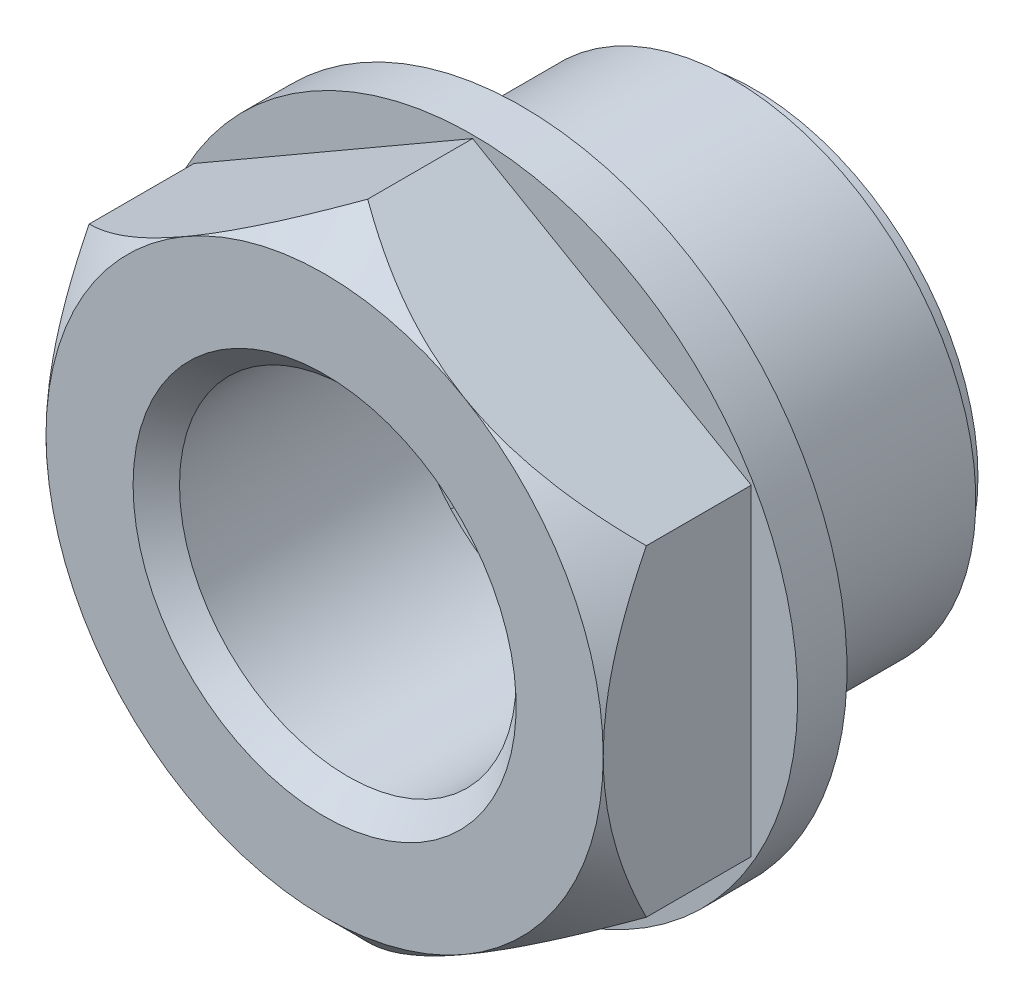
ISO-10303-21;
HEADER;
FILE_DESCRIPTION(('STEP AP214'),'2;1');
FILE_NAME('part.step','',(''),(''),'','','');
FILE_SCHEMA(('AUTOMOTIVE_DESIGN { 1 0 10303 214 1 1 1 1 }'));
ENDSEC;
DATA;
#1=APPLICATION_CONTEXT('core data for automotive mechanical design processes');
#2=APPLICATION_PROTOCOL_DEFINITION('international standard','automotive_design',2000,#1);
#3=PRODUCT_CONTEXT('',#1,'mechanical');
#4=PRODUCT('Part','Part','',(#3));
#5=PRODUCT_RELATED_PRODUCT_CATEGORY('part','',(#4));
#6=PRODUCT_DEFINITION_FORMATION('','',#4);
#7=PRODUCT_DEFINITION_CONTEXT('part definition',#1,'design');
#8=PRODUCT_DEFINITION('design','',#6,#7);
#9=PRODUCT_DEFINITION_SHAPE('','',#8);
#10=(LENGTH_UNIT() NAMED_UNIT(*) SI_UNIT(.MILLI.,.METRE.));
#11=(NAMED_UNIT(*) PLANE_ANGLE_UNIT() SI_UNIT($,.RADIAN.));
#12=(NAMED_UNIT(*) SI_UNIT($,.STERADIAN.) SOLID_ANGLE_UNIT());
#13=UNCERTAINTY_MEASURE_WITH_UNIT(LENGTH_MEASURE(1.E-05),#10,'distance_accuracy_value','');
#14=(GEOMETRIC_REPRESENTATION_CONTEXT(3) GLOBAL_UNCERTAINTY_ASSIGNED_CONTEXT((#13)) GLOBAL_UNIT_ASSIGNED_CONTEXT((#10,
#11,#12)) REPRESENTATION_CONTEXT('',''));
#15=CARTESIAN_POINT('',(0.,0.,0.));
#16=DIRECTION('',(0.,0.,1.));
#17=DIRECTION('',(1.,0.,0.));
#18=AXIS2_PLACEMENT_3D('',#15,#16,#17);
#19=CARTESIAN_POINT('',(-6.1134752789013,-5.5396678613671,-2.8076923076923));
#20=DIRECTION('',(0.671474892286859,-0.741027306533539,0.));
#21=DIRECTION('',(0.741027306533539,0.671474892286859,0.));
#22=AXIS2_PLACEMENT_3D('',#19,#20,#21);
#23=PLANE('',#22);
#24=DIRECTION('',(0.741027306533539,0.671474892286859,0.));
#25=VECTOR('',#24,1.);
#26=CARTESIAN_POINT('',(-6.1134752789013,-5.5396678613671,-2.3076923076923));
#27=LINE('',#26,#25);
#28=CARTESIAN_POINT('',(-6.1134752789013,-5.5396678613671,-2.3076923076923));
#29=VERTEX_POINT('',#28);
#30=CARTESIAN_POINT('',(-5.372640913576,-4.8683678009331,-2.3076923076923));
#31=VERTEX_POINT('',#30);
#32=EDGE_CURVE('E314',#29,#31,#27,.T.);
#33=ORIENTED_EDGE('',*,*,#32,.F.);
#34=DIRECTION('',(0.,0.,1.));
#35=VECTOR('',#34,1.);
#36=CARTESIAN_POINT('',(-6.1134752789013,-5.5396678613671,-2.8076923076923));
#37=LINE('',#36,#35);
#38=CARTESIAN_POINT('',(-6.1134752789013,-5.5396678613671,-2.8076923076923));
#39=VERTEX_POINT('',#38);
#40=EDGE_CURVE('E415',#39,#29,#37,.T.);
#41=ORIENTED_EDGE('',*,*,#40,.F.);
#42=DIRECTION('',(0.741027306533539,0.671474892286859,0.));
#43=VECTOR('',#42,1.);
#44=CARTESIAN_POINT('',(-6.1134752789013,-5.5396678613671,-2.8076923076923));
#45=LINE('',#44,#43);
#46=CARTESIAN_POINT('',(-5.372640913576,-4.8683678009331,-2.8076923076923));
#47=VERTEX_POINT('',#46);
#48=EDGE_CURVE('E318',#39,#47,#45,.T.);
#49=ORIENTED_EDGE('',*,*,#48,.T.);
#50=DIRECTION('',(0.,0.,1.));
#51=VECTOR('',#50,1.);
#52=CARTESIAN_POINT('',(-5.372640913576,-4.8683678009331,-2.8076923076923));
#53=LINE('',#52,#51);
#54=EDGE_CURVE('E412',#47,#31,#53,.T.);
#55=ORIENTED_EDGE('',*,*,#54,.T.);
#56=EDGE_LOOP('',(#33,#41,#49,#55));
#57=FACE_BOUND('',#56,.T.);
#58=ADVANCED_FACE('F14',(#57),#23,.T.);
#59=CARTESIAN_POINT('',(3.3793694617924,-7.5261120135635,-2.8076923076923));
#60=DIRECTION('',(0.912256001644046,0.409620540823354,0.));
#61=DIRECTION('',(-0.409620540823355,0.912256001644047,0.));
#62=AXIS2_PLACEMENT_3D('',#59,#60,#61);
#63=PLANE('',#62);
#64=DIRECTION('',(-0.409620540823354,0.912256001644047,0.));
#65=VECTOR('',#64,1.);
#66=CARTESIAN_POINT('',(3.3793694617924,-7.5261120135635,-2.3076923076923));
#67=LINE('',#66,#65);
#68=CARTESIAN_POINT('',(3.37936946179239,-7.5261120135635,-2.3076923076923));
#69=VERTEX_POINT('',#68);
#70=CARTESIAN_POINT('',(2.9698555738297,-6.6140935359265,-2.3076923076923));
#71=VERTEX_POINT('',#70);
#72=EDGE_CURVE('E623',#69,#71,#67,.T.);
#73=ORIENTED_EDGE('',*,*,#72,.F.);
#74=DIRECTION('',(0.,0.,1.));
#75=VECTOR('',#74,1.);
#76=CARTESIAN_POINT('',(3.37936946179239,-7.5261120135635,-2.8076923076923));
#77=LINE('',#76,#75);
#78=CARTESIAN_POINT('',(3.37936946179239,-7.5261120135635,-2.8076923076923));
#79=VERTEX_POINT('',#78);
#80=EDGE_CURVE('E405',#79,#69,#77,.T.);
#81=ORIENTED_EDGE('',*,*,#80,.F.);
#82=DIRECTION('',(-0.409620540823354,0.912256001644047,0.));
#83=VECTOR('',#82,1.);
#84=CARTESIAN_POINT('',(3.3793694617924,-7.5261120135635,-2.8076923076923));
#85=LINE('',#84,#83);
#86=CARTESIAN_POINT('',(2.9698555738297,-6.6140935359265,-2.8076923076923));
#87=VERTEX_POINT('',#86);
#88=EDGE_CURVE('E330',#79,#87,#85,.T.);
#89=ORIENTED_EDGE('',*,*,#88,.T.);
#90=DIRECTION('',(0.,0.,1.));
#91=VECTOR('',#90,1.);
#92=CARTESIAN_POINT('',(2.9698555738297,-6.6140935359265,-2.8076923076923));
#93=LINE('',#92,#91);
#94=EDGE_CURVE('E402',#87,#71,#93,.T.);
#95=ORIENTED_EDGE('',*,*,#94,.T.);
#96=EDGE_LOOP('',(#73,#81,#89,#95));
#97=FACE_BOUND('',#96,.T.);
#98=ADVANCED_FACE('F557',(#97),#63,.T.);
#99=CARTESIAN_POINT('',(8.2020404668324,0.88827483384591,-2.8076923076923));
#100=DIRECTION('',(-0.107669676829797,0.994186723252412,0.));
#101=DIRECTION('',(-0.994186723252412,-0.107669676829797,0.));
#102=AXIS2_PLACEMENT_3D('',#99,#100,#101);
#103=PLANE('',#102);
#104=DIRECTION('',(-0.994186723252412,-0.107669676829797,0.));
#105=VECTOR('',#104,1.);
#106=CARTESIAN_POINT('',(8.2020404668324,0.88827483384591,-2.3076923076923));
#107=LINE('',#106,#105);
#108=CARTESIAN_POINT('',(8.2020404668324,0.888274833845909,-2.3076923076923));
#109=VERTEX_POINT('',#108);
#110=CARTESIAN_POINT('',(7.2081125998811,0.78063319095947,-2.3076923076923));
#111=VERTEX_POINT('',#110);
#112=EDGE_CURVE('E647',#109,#111,#107,.T.);
#113=ORIENTED_EDGE('',*,*,#112,.F.);
#114=DIRECTION('',(0.,0.,1.));
#115=VECTOR('',#114,1.);
#116=CARTESIAN_POINT('',(8.2020404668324,0.888274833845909,-2.8076923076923));
#117=LINE('',#116,#115);
#118=CARTESIAN_POINT('',(8.2020404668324,0.888274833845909,-2.8076923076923));
#119=VERTEX_POINT('',#118);
#120=EDGE_CURVE('E395',#119,#109,#117,.T.);
#121=ORIENTED_EDGE('',*,*,#120,.F.);
#122=DIRECTION('',(-0.994186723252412,-0.107669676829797,0.));
#123=VECTOR('',#122,1.);
#124=CARTESIAN_POINT('',(8.2020404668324,0.88827483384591,-2.8076923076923));
#125=LINE('',#124,#123);
#126=CARTESIAN_POINT('',(7.2081125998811,0.78063319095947,-2.8076923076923));
#127=VERTEX_POINT('',#126);
#128=EDGE_CURVE('E342',#119,#127,#125,.T.);
#129=ORIENTED_EDGE('',*,*,#128,.T.);
#130=DIRECTION('',(0.,0.,1.));
#131=VECTOR('',#130,1.);
#132=CARTESIAN_POINT('',(7.2081125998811,0.78063319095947,-2.8076923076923));
#133=LINE('',#132,#131);
#134=EDGE_CURVE('E392',#127,#111,#133,.T.);
#135=ORIENTED_EDGE('',*,*,#134,.T.);
#136=EDGE_LOOP('',(#113,#121,#129,#135));
#137=FACE_BOUND('',#136,.T.);
#138=ADVANCED_FACE('F564',(#137),#103,.T.);
#139=CARTESIAN_POINT('',(1.6897703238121,8.0750960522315,-2.8076923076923));
#140=DIRECTION('',(-0.978799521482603,0.204820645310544,0.));
#141=DIRECTION('',(-0.204820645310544,-0.978799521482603,0.));
#142=AXIS2_PLACEMENT_3D('',#139,#140,#141);
#143=PLANE('',#142);
#144=DIRECTION('',(-0.204820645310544,-0.978799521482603,0.));
#145=VECTOR('',#144,1.);
#146=CARTESIAN_POINT('',(1.6897703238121,8.0750960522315,-2.3076923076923));
#147=LINE('',#146,#145);
#148=CARTESIAN_POINT('',(1.6897703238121,8.0750960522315,-2.3076923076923));
#149=VERTEX_POINT('',#148);
#150=CARTESIAN_POINT('',(1.4850030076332,7.0965513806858,-2.3076923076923));
#151=VERTEX_POINT('',#150);
#152=EDGE_CURVE('E269',#149,#151,#147,.T.);
#153=ORIENTED_EDGE('',*,*,#152,.F.);
#154=DIRECTION('',(0.,0.,1.));
#155=VECTOR('',#154,1.);
#156=CARTESIAN_POINT('',(1.6897703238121,8.0750960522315,-2.8076923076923));
#157=LINE('',#156,#155);
#158=CARTESIAN_POINT('',(1.6897703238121,8.0750960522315,-2.8076923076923));
#159=VERTEX_POINT('',#158);
#160=EDGE_CURVE('E385',#159,#149,#157,.T.);
#161=ORIENTED_EDGE('',*,*,#160,.F.);
#162=DIRECTION('',(-0.204820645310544,-0.978799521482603,0.));
#163=VECTOR('',#162,1.);
#164=CARTESIAN_POINT('',(1.6897703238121,8.0750960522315,-2.8076923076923));
#165=LINE('',#164,#163);
#166=CARTESIAN_POINT('',(1.4850030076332,7.0965513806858,-2.8076923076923));
#167=VERTEX_POINT('',#166);
#168=EDGE_CURVE('E354',#159,#167,#165,.T.);
#169=ORIENTED_EDGE('',*,*,#168,.T.);
#170=DIRECTION('',(0.,0.,1.));
#171=VECTOR('',#170,1.);
#172=CARTESIAN_POINT('',(1.4850030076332,7.0965513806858,-2.8076923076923));
#173=LINE('',#172,#171);
#174=EDGE_CURVE('E382',#167,#151,#173,.T.);
#175=ORIENTED_EDGE('',*,*,#174,.T.);
#176=EDGE_LOOP('',(#153,#161,#169,#175));
#177=FACE_BOUND('',#176,.T.);
#178=ADVANCED_FACE('F573',(#177),#143,.T.);
#179=CARTESIAN_POINT('',(-6.290330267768,-3.6052767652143,-2.8076923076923));
#180=DIRECTION('',(-0.497261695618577,0.867600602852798,0.));
#181=DIRECTION('',(-0.867600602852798,-0.497261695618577,0.));
#182=AXIS2_PLACEMENT_3D('',#179,#180,#181);
#183=PLANE('',#182);
#184=DIRECTION('',(-0.867600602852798,-0.497261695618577,0.));
#185=VECTOR('',#184,1.);
#186=CARTESIAN_POINT('',(-6.290330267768,-3.6052767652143,-2.3076923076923));
#187=LINE('',#186,#185);
#188=CARTESIAN_POINT('',(-6.290330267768,-3.6052767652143,-2.3076923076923));
#189=VERTEX_POINT('',#188);
#190=CARTESIAN_POINT('',(-7.1577049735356,-4.1024089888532,-2.3076923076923));
#191=VERTEX_POINT('',#190);
#192=EDGE_CURVE('E311',#189,#191,#187,.T.);
#193=ORIENTED_EDGE('',*,*,#192,.F.);
#194=DIRECTION('',(0.,0.,1.));
#195=VECTOR('',#194,1.);
#196=CARTESIAN_POINT('',(-6.290330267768,-3.6052767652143,-2.8076923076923));
#197=LINE('',#196,#195);
#198=CARTESIAN_POINT('',(-6.290330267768,-3.6052767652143,-2.8076923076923));
#199=VERTEX_POINT('',#198);
#200=EDGE_CURVE('E371',#199,#189,#197,.T.);
#201=ORIENTED_EDGE('',*,*,#200,.F.);
#202=DIRECTION('',(-0.867600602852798,-0.497261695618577,0.));
#203=VECTOR('',#202,1.);
#204=CARTESIAN_POINT('',(-6.290330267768,-3.6052767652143,-2.8076923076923));
#205=LINE('',#204,#203);
#206=CARTESIAN_POINT('',(-7.1577049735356,-4.1024089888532,-2.8076923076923));
#207=VERTEX_POINT('',#206);
#208=EDGE_CURVE('E309',#199,#207,#205,.T.);
#209=ORIENTED_EDGE('',*,*,#208,.T.);
#210=DIRECTION('',(0.,0.,1.));
#211=VECTOR('',#210,1.);
#212=CARTESIAN_POINT('',(-7.1577049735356,-4.1024089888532,-2.8076923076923));
#213=LINE('',#212,#211);
#214=EDGE_CURVE('E115',#207,#191,#213,.T.);
#215=ORIENTED_EDGE('',*,*,#214,.T.);
#216=EDGE_LOOP('',(#193,#201,#209,#215));
#217=FACE_BOUND('',#216,.T.);
#218=ADVANCED_FACE('F570',(#217),#183,.T.);
#219=CARTESIAN_POINT('',(4.96972770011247E-12,3.24046345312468E-12,-2.8076923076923));
#220=DIRECTION('',(0.,0.,1.));
#221=DIRECTION('',(0.,1.,0.));
#222=AXIS2_PLACEMENT_3D('',#219,#220,#221);
#223=PLANE('',#222);
#224=ORIENTED_EDGE('',*,*,#208,.F.);
#225=CARTESIAN_POINT('',(-7.91701322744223,0.,-2.8076923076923));
#226=DIRECTION('',(0.,0.,-1.));
#227=DIRECTION('',(0.,1.,0.));
#228=AXIS2_PLACEMENT_3D('',#225,#226,#227);
#229=CIRCLE('',#228,3.95526459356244);
#230=CARTESIAN_POINT('',(-6.290330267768,3.6052767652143,-2.8076923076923));
#231=VERTEX_POINT('',#230);
#232=EDGE_CURVE('E368',#231,#199,#229,.T.);
#233=ORIENTED_EDGE('',*,*,#232,.F.);
#234=DIRECTION('',(0.867600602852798,-0.497261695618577,0.));
#235=VECTOR('',#234,1.);
#236=CARTESIAN_POINT('',(-7.1577049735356,4.1024089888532,-2.8076923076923));
#237=LINE('',#236,#235);
#238=CARTESIAN_POINT('',(-7.1577049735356,4.1024089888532,-2.8076923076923));
#239=VERTEX_POINT('',#238);
#240=EDGE_CURVE('E365',#239,#231,#237,.T.);
#241=ORIENTED_EDGE('',*,*,#240,.F.);
#242=CARTESIAN_POINT('',(-3.70618520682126E-13,2.15105711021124E-13,-2.8076923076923));
#243=DIRECTION('',(0.,0.,1.));
#244=DIRECTION('',(0.,1.,0.));
#245=AXIS2_PLACEMENT_3D('',#242,#243,#244);
#246=CIRCLE('',#245,8.24999999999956);
#247=CARTESIAN_POINT('',(-6.1134752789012,5.5396678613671,-2.8076923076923));
#248=VERTEX_POINT('',#247);
#249=EDGE_CURVE('E362',#248,#239,#246,.T.);
#250=ORIENTED_EDGE('',*,*,#249,.F.);
#251=DIRECTION('',(-0.741027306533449,0.671474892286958,0.));
#252=VECTOR('',#251,1.);
#253=CARTESIAN_POINT('',(-5.3726409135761,4.8683678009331,-2.8076923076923));
#254=LINE('',#253,#252);
#255=CARTESIAN_POINT('',(-5.3726409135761,4.8683678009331,-2.8076923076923));
#256=VERTEX_POINT('',#255);
#257=EDGE_CURVE('E359',#256,#248,#254,.T.);
#258=ORIENTED_EDGE('',*,*,#257,.F.);
#259=CARTESIAN_POINT('',(-2.44649163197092,7.52952701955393,-2.8076923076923));
#260=DIRECTION('',(0.,0.,-1.));
#261=DIRECTION('',(0.,1.,0.));
#262=AXIS2_PLACEMENT_3D('',#259,#260,#261);
#263=CIRCLE('',#262,3.9552645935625);
#264=EDGE_CURVE('E357',#167,#256,#263,.T.);
#265=ORIENTED_EDGE('',*,*,#264,.F.);
#266=ORIENTED_EDGE('',*,*,#168,.F.);
#267=CARTESIAN_POINT('',(-2.51517041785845E-12,-6.92675083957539E-12,-2.8076923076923));
#268=DIRECTION('',(0.,0.,1.));
#269=DIRECTION('',(0.,1.,0.));
#270=AXIS2_PLACEMENT_3D('',#267,#268,#269);
#271=CIRCLE('',#270,8.25000000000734);
#272=CARTESIAN_POINT('',(3.3793694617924,7.5261120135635,-2.8076923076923));
#273=VERTEX_POINT('',#272);
#274=EDGE_CURVE('E351',#273,#159,#271,.T.);
#275=ORIENTED_EDGE('',*,*,#274,.F.);
#276=DIRECTION('',(0.409620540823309,0.912256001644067,0.));
#277=VECTOR('',#276,1.);
#278=CARTESIAN_POINT('',(2.9698555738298,6.6140935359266,-2.8076923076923));
#279=LINE('',#278,#277);
#280=CARTESIAN_POINT('',(2.9698555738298,6.6140935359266,-2.8076923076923));
#281=VERTEX_POINT('',#280);
#282=EDGE_CURVE('E348',#281,#273,#279,.T.);
#283=ORIENTED_EDGE('',*,*,#282,.F.);
#284=CARTESIAN_POINT('',(6.40499824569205,4.65350361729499,-2.8076923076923));
#285=DIRECTION('',(0.,0.,-1.));
#286=DIRECTION('',(0.,1.,0.));
#287=AXIS2_PLACEMENT_3D('',#284,#285,#286);
#288=CIRCLE('',#287,3.95526459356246);
#289=EDGE_CURVE('E345',#127,#281,#288,.T.);
#290=ORIENTED_EDGE('',*,*,#289,.F.);
#291=ORIENTED_EDGE('',*,*,#128,.F.);
#292=CARTESIAN_POINT('',(-2.4297352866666E-12,0.,-2.8076923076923));
#293=DIRECTION('',(0.,0.,1.));
#294=DIRECTION('',(0.,1.,0.));
#295=AXIS2_PLACEMENT_3D('',#292,#293,#294);
#296=CIRCLE('',#295,8.25000000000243);
#297=CARTESIAN_POINT('',(8.2020404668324,-0.88827483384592,-2.8076923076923));
#298=VERTEX_POINT('',#297);
#299=EDGE_CURVE('E339',#298,#119,#296,.T.);
#300=ORIENTED_EDGE('',*,*,#299,.F.);
#301=DIRECTION('',(0.994186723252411,-0.107669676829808,0.));
#302=VECTOR('',#301,1.);
#303=CARTESIAN_POINT('',(7.2081125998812,-0.78063319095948,-2.8076923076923));
#304=LINE('',#303,#302);
#305=CARTESIAN_POINT('',(7.2081125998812,-0.780633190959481,-2.8076923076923));
#306=VERTEX_POINT('',#305);
#307=EDGE_CURVE('E336',#306,#298,#304,.T.);
#308=ORIENTED_EDGE('',*,*,#307,.F.);
#309=CARTESIAN_POINT('',(6.40499824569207,-4.65350361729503,-2.8076923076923));
#310=DIRECTION('',(0.,0.,-1.));
#311=DIRECTION('',(0.,-1.,0.));
#312=AXIS2_PLACEMENT_3D('',#309,#310,#311);
#313=CIRCLE('',#312,3.9552645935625);
#314=EDGE_CURVE('E333',#87,#306,#313,.T.);
#315=ORIENTED_EDGE('',*,*,#314,.F.);
#316=ORIENTED_EDGE('',*,*,#88,.F.);
#317=CARTESIAN_POINT('',(-2.51473673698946E-12,6.9258834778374E-12,-2.8076923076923));
#318=DIRECTION('',(0.,0.,1.));
#319=DIRECTION('',(0.,1.,0.));
#320=AXIS2_PLACEMENT_3D('',#317,#318,#319);
#321=CIRCLE('',#320,8.25000000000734);
#322=CARTESIAN_POINT('',(1.6897703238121,-8.0750960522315,-2.8076923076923));
#323=VERTEX_POINT('',#322);
#324=EDGE_CURVE('E327',#323,#79,#321,.T.);
#325=ORIENTED_EDGE('',*,*,#324,.F.);
#326=DIRECTION('',(0.204820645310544,-0.978799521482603,0.));
#327=VECTOR('',#326,1.);
#328=CARTESIAN_POINT('',(1.4850030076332,-7.0965513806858,-2.8076923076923));
#329=LINE('',#328,#327);
#330=CARTESIAN_POINT('',(1.4850030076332,-7.0965513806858,-2.8076923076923));
#331=VERTEX_POINT('',#330);
#332=EDGE_CURVE('E324',#331,#323,#329,.T.);
#333=ORIENTED_EDGE('',*,*,#332,.F.);
#334=CARTESIAN_POINT('',(-2.44649163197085,-7.52952701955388,-2.8076923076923));
#335=DIRECTION('',(0.,0.,-1.));
#336=DIRECTION('',(0.,-1.,0.));
#337=AXIS2_PLACEMENT_3D('',#334,#335,#336);
#338=CIRCLE('',#337,3.95526459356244);
#339=EDGE_CURVE('E321',#47,#331,#338,.T.);
#340=ORIENTED_EDGE('',*,*,#339,.F.);
#341=ORIENTED_EDGE('',*,*,#48,.F.);
#342=CARTESIAN_POINT('',(4.96972770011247E-12,3.24046345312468E-12,-2.8076923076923));
#343=DIRECTION('',(0.,0.,1.));
#344=DIRECTION('',(0.,1.,0.));
#345=AXIS2_PLACEMENT_3D('',#342,#343,#344);
#346=CIRCLE('',#345,8.25000000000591);
#347=EDGE_CURVE('E315',#207,#39,#346,.T.);
#348=ORIENTED_EDGE('',*,*,#347,.F.);
#349=EDGE_LOOP('',(#224,#233,#241,#250,#258,#265,#266,#275,#283,#290,#291,#300,#308,#315,#316,
#325,#333,#340,#341,#348));
#350=FACE_BOUND('',#349,.T.);
#351=ADVANCED_FACE('F572',(#350),#223,.F.);
#352=CARTESIAN_POINT('',(-7.1577049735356,4.1024089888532,-2.8076923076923));
#353=DIRECTION('',(-0.497261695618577,-0.867600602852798,0.));
#354=DIRECTION('',(0.867600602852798,-0.497261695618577,0.));
#355=AXIS2_PLACEMENT_3D('',#352,#353,#354);
#356=PLANE('',#355);
#357=DIRECTION('',(0.867600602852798,-0.497261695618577,0.));
#358=VECTOR('',#357,1.);
#359=CARTESIAN_POINT('',(-7.1577049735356,4.1024089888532,-2.3076923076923));
#360=LINE('',#359,#358);
#361=CARTESIAN_POINT('',(-7.1577049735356,4.1024089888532,-2.3076923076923));
#362=VERTEX_POINT('',#361);
#363=CARTESIAN_POINT('',(-6.290330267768,3.6052767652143,-2.3076923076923));
#364=VERTEX_POINT('',#363);
#365=EDGE_CURVE('E302',#362,#364,#360,.T.);
#366=ORIENTED_EDGE('',*,*,#365,.F.);
#367=DIRECTION('',(0.,0.,1.));
#368=VECTOR('',#367,1.);
#369=CARTESIAN_POINT('',(-7.1577049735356,4.1024089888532,-2.8076923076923));
#370=LINE('',#369,#368);
#371=EDGE_CURVE('E377',#239,#362,#370,.T.);
#372=ORIENTED_EDGE('',*,*,#371,.F.);
#373=ORIENTED_EDGE('',*,*,#240,.T.);
#374=DIRECTION('',(0.,0.,1.));
#375=VECTOR('',#374,1.);
#376=CARTESIAN_POINT('',(-6.290330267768,3.6052767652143,-2.8076923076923));
#377=LINE('',#376,#375);
#378=EDGE_CURVE('E374',#231,#364,#377,.T.);
#379=ORIENTED_EDGE('',*,*,#378,.T.);
#380=EDGE_LOOP('',(#366,#372,#373,#379));
#381=FACE_BOUND('',#380,.T.);
#382=ADVANCED_FACE('F579',(#381),#356,.T.);
#383=CARTESIAN_POINT('',(6.40499824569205,4.65350361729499,-2.8076923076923));
#384=DIRECTION('',(0.,0.,1.));
#385=DIRECTION('',(1.,0.,0.));
#386=AXIS2_PLACEMENT_3D('',#383,#384,#385);
#387=CYLINDRICAL_SURFACE('',#386,3.95526459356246);
#388=CARTESIAN_POINT('',(6.40499824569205,4.65350361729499,-2.3076923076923));
#389=DIRECTION('',(0.,0.,-1.));
#390=DIRECTION('',(0.,1.,0.));
#391=AXIS2_PLACEMENT_3D('',#388,#389,#390);
#392=CIRCLE('',#391,3.95526459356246);
#393=CARTESIAN_POINT('',(7.20785645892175,0.780580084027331,-2.3076923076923));
#394=VERTEX_POINT('',#393);
#395=EDGE_CURVE('E651',#111,#394,#392,.T.);
#396=ORIENTED_EDGE('',*,*,#395,.F.);
#397=ORIENTED_EDGE('',*,*,#134,.F.);
#398=ORIENTED_EDGE('',*,*,#289,.T.);
#399=DIRECTION('',(0.,0.,1.));
#400=VECTOR('',#399,1.);
#401=CARTESIAN_POINT('',(2.9698555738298,6.6140935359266,-2.8076923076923));
#402=LINE('',#401,#400);
#403=CARTESIAN_POINT('',(2.9698555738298,6.6140935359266,-2.3076923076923));
#404=VERTEX_POINT('',#403);
#405=EDGE_CURVE('E389',#281,#404,#402,.T.);
#406=ORIENTED_EDGE('',*,*,#405,.T.);
#407=CARTESIAN_POINT('',(2.96972591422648,6.61386634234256,-2.3076923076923));
#408=VERTEX_POINT('',#407);
#409=EDGE_CURVE('E650',#408,#404,#392,.T.);
#410=ORIENTED_EDGE('',*,*,#409,.F.);
#411=EDGE_CURVE('E654',#394,#408,#392,.T.);
#412=ORIENTED_EDGE('',*,*,#411,.F.);
#413=EDGE_LOOP('',(#396,#397,#398,#406,#410,#412));
#414=FACE_BOUND('',#413,.T.);
#415=ADVANCED_FACE('F673',(#414),#387,.F.);
#416=CARTESIAN_POINT('',(6.40499824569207,-4.65350361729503,-2.8076923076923));
#417=DIRECTION('',(0.,0.,1.));
#418=DIRECTION('',(1.,0.,0.));
#419=AXIS2_PLACEMENT_3D('',#416,#417,#418);
#420=CYLINDRICAL_SURFACE('',#419,3.9552645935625);
#421=CARTESIAN_POINT('',(6.40499824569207,-4.65350361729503,-2.3076923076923));
#422=DIRECTION('',(0.,0.,-1.));
#423=DIRECTION('',(0.,-1.,0.));
#424=AXIS2_PLACEMENT_3D('',#421,#422,#423);
#425=CIRCLE('',#424,3.9552645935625);
#426=CARTESIAN_POINT('',(2.96972591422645,-6.61386634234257,-2.3076923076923));
#427=VERTEX_POINT('',#426);
#428=EDGE_CURVE('E639',#71,#427,#425,.T.);
#429=ORIENTED_EDGE('',*,*,#428,.F.);
#430=ORIENTED_EDGE('',*,*,#94,.F.);
#431=ORIENTED_EDGE('',*,*,#314,.T.);
#432=DIRECTION('',(0.,0.,1.));
#433=VECTOR('',#432,1.);
#434=CARTESIAN_POINT('',(7.2081125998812,-0.780633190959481,-2.8076923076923));
#435=LINE('',#434,#433);
#436=CARTESIAN_POINT('',(7.2081125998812,-0.780633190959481,-2.3076923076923));
#437=VERTEX_POINT('',#436);
#438=EDGE_CURVE('E399',#306,#437,#435,.T.);
#439=ORIENTED_EDGE('',*,*,#438,.T.);
#440=CARTESIAN_POINT('',(7.20785645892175,-0.780580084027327,-2.3076923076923));
#441=VERTEX_POINT('',#440);
#442=EDGE_CURVE('E630',#441,#437,#425,.T.);
#443=ORIENTED_EDGE('',*,*,#442,.F.);
#444=EDGE_CURVE('E637',#427,#441,#425,.T.);
#445=ORIENTED_EDGE('',*,*,#444,.F.);
#446=EDGE_LOOP('',(#429,#430,#431,#439,#443,#445));
#447=FACE_BOUND('',#446,.T.);
#448=ADVANCED_FACE('F726',(#447),#420,.F.);
#449=CARTESIAN_POINT('',(-2.44649163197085,-7.52952701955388,-2.8076923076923));
#450=DIRECTION('',(0.,0.,1.));
#451=DIRECTION('',(1.,0.,0.));
#452=AXIS2_PLACEMENT_3D('',#449,#450,#451);
#453=CYLINDRICAL_SURFACE('',#452,3.95526459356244);
#454=CARTESIAN_POINT('',(-2.44649163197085,-7.52952701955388,-2.3076923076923));
#455=DIRECTION('',(0.,0.,-1.));
#456=DIRECTION('',(0.,-1.,0.));
#457=AXIS2_PLACEMENT_3D('',#454,#455,#456);
#458=CIRCLE('',#457,3.95526459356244);
#459=CARTESIAN_POINT('',(-5.37246490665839,-4.86817428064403,-2.3076923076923));
#460=VERTEX_POINT('',#459);
#461=EDGE_CURVE('E641',#31,#460,#458,.T.);
#462=ORIENTED_EDGE('',*,*,#461,.F.);
#463=ORIENTED_EDGE('',*,*,#54,.F.);
#464=ORIENTED_EDGE('',*,*,#339,.T.);
#465=DIRECTION('',(0.,0.,1.));
#466=VECTOR('',#465,1.);
#467=CARTESIAN_POINT('',(1.4850030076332,-7.0965513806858,-2.8076923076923));
#468=LINE('',#467,#466);
#469=CARTESIAN_POINT('',(1.4850030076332,-7.0965513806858,-2.3076923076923));
#470=VERTEX_POINT('',#469);
#471=EDGE_CURVE('E409',#331,#470,#468,.T.);
#472=ORIENTED_EDGE('',*,*,#471,.T.);
#473=CARTESIAN_POINT('',(1.48497436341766,-7.0962913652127,-2.3076923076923));
#474=VERTEX_POINT('',#473);
#475=EDGE_CURVE('E700',#474,#470,#458,.T.);
#476=ORIENTED_EDGE('',*,*,#475,.F.);
#477=EDGE_CURVE('E704',#460,#474,#458,.T.);
#478=ORIENTED_EDGE('',*,*,#477,.F.);
#479=EDGE_LOOP('',(#462,#463,#464,#472,#476,#478));
#480=FACE_BOUND('',#479,.T.);
#481=ADVANCED_FACE('F569',(#480),#453,.F.);
#482=CARTESIAN_POINT('',(-7.91701322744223,0.,-2.8076923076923));
#483=DIRECTION('',(0.,0.,1.));
#484=DIRECTION('',(1.,0.,0.));
#485=AXIS2_PLACEMENT_3D('',#482,#483,#484);
#486=CYLINDRICAL_SURFACE('',#485,3.95526459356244);
#487=CARTESIAN_POINT('',(-7.91701322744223,0.,-2.3076923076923));
#488=DIRECTION('',(0.,0.,-1.));
#489=DIRECTION('',(0.,1.,0.));
#490=AXIS2_PLACEMENT_3D('',#487,#488,#489);
#491=CIRCLE('',#490,3.95526459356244);
#492=CARTESIAN_POINT('',(-6.29009182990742,3.60516917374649,-2.3076923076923));
#493=VERTEX_POINT('',#492);
#494=EDGE_CURVE('E306',#364,#493,#491,.T.);
#495=ORIENTED_EDGE('',*,*,#494,.F.);
#496=ORIENTED_EDGE('',*,*,#378,.F.);
#497=ORIENTED_EDGE('',*,*,#232,.T.);
#498=ORIENTED_EDGE('',*,*,#200,.T.);
#499=CARTESIAN_POINT('',(-6.29009182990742,-3.60516917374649,-2.3076923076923));
#500=VERTEX_POINT('',#499);
#501=EDGE_CURVE('E40',#500,#189,#491,.T.);
#502=ORIENTED_EDGE('',*,*,#501,.F.);
#503=EDGE_CURVE('E310',#493,#500,#491,.T.);
#504=ORIENTED_EDGE('',*,*,#503,.F.);
#505=EDGE_LOOP('',(#495,#496,#497,#498,#502,#504));
#506=FACE_BOUND('',#505,.T.);
#507=ADVANCED_FACE('F589',(#506),#486,.F.);
#508=CARTESIAN_POINT('',(-2.44649163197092,7.52952701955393,-2.8076923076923));
#509=DIRECTION('',(0.,0.,1.));
#510=DIRECTION('',(1.,0.,0.));
#511=AXIS2_PLACEMENT_3D('',#508,#509,#510);
#512=CYLINDRICAL_SURFACE('',#511,3.9552645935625);
#513=CARTESIAN_POINT('',(-2.44649163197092,7.52952701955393,-2.3076923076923));
#514=DIRECTION('',(0.,0.,-1.));
#515=DIRECTION('',(0.,1.,0.));
#516=AXIS2_PLACEMENT_3D('',#513,#514,#515);
#517=CIRCLE('',#516,3.9552645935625);
#518=CARTESIAN_POINT('',(1.48497436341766,7.0962913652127,-2.3076923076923));
#519=VERTEX_POINT('',#518);
#520=EDGE_CURVE('E271',#151,#519,#517,.T.);
#521=ORIENTED_EDGE('',*,*,#520,.F.);
#522=ORIENTED_EDGE('',*,*,#174,.F.);
#523=ORIENTED_EDGE('',*,*,#264,.T.);
#524=DIRECTION('',(0.,0.,1.));
#525=VECTOR('',#524,1.);
#526=CARTESIAN_POINT('',(-5.3726409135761,4.8683678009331,-2.8076923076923));
#527=LINE('',#526,#525);
#528=CARTESIAN_POINT('',(-5.3726409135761,4.8683678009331,-2.3076923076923));
#529=VERTEX_POINT('',#528);
#530=EDGE_CURVE('E264',#256,#529,#527,.T.);
#531=ORIENTED_EDGE('',*,*,#530,.T.);
#532=CARTESIAN_POINT('',(-5.37246490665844,4.86817428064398,-2.3076923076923));
#533=VERTEX_POINT('',#532);
#534=EDGE_CURVE('E258',#533,#529,#517,.T.);
#535=ORIENTED_EDGE('',*,*,#534,.F.);
#536=EDGE_CURVE('E262',#519,#533,#517,.T.);
#537=ORIENTED_EDGE('',*,*,#536,.F.);
#538=EDGE_LOOP('',(#521,#522,#523,#531,#535,#537));
#539=FACE_BOUND('',#538,.T.);
#540=ADVANCED_FACE('F260',(#539),#512,.F.);
#541=CARTESIAN_POINT('',(4.96972770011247E-12,3.24046345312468E-12,-2.3076923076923));
#542=DIRECTION('',(0.,0.,1.));
#543=DIRECTION('',(0.,1.,0.));
#544=AXIS2_PLACEMENT_3D('',#541,#542,#543);
#545=PLANE('',#544);
#546=ORIENTED_EDGE('',*,*,#536,.T.);
#547=CARTESIAN_POINT('',(0.,0.,-2.3076923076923));
#548=DIRECTION('',(0.,0.,1.));
#549=DIRECTION('',(0.,1.,0.));
#550=AXIS2_PLACEMENT_3D('',#547,#548,#549);
#551=CIRCLE('',#550,7.25);
#552=EDGE_CURVE('E9',#533,#493,#551,.T.);
#553=ORIENTED_EDGE('',*,*,#552,.T.);
#554=ORIENTED_EDGE('',*,*,#503,.T.);
#555=EDGE_CURVE('E30',#500,#460,#551,.T.);
#556=ORIENTED_EDGE('',*,*,#555,.T.);
#557=ORIENTED_EDGE('',*,*,#477,.T.);
#558=EDGE_CURVE('E689',#474,#427,#551,.T.);
#559=ORIENTED_EDGE('',*,*,#558,.T.);
#560=ORIENTED_EDGE('',*,*,#444,.T.);
#561=EDGE_CURVE('E418',#441,#394,#551,.T.);
#562=ORIENTED_EDGE('',*,*,#561,.T.);
#563=ORIENTED_EDGE('',*,*,#411,.T.);
#564=EDGE_CURVE('E32',#408,#519,#551,.T.);
#565=ORIENTED_EDGE('',*,*,#564,.T.);
#566=EDGE_LOOP('',(#546,#553,#554,#556,#557,#559,#560,#562,#563,#565));
#567=FACE_BOUND('',#566,.T.);
#568=ADVANCED_FACE('F289',(#567),#545,.T.);
#569=CARTESIAN_POINT('',(-5.3726409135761,4.8683678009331,-2.8076923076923));
#570=DIRECTION('',(0.671474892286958,0.741027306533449,0.));
#571=DIRECTION('',(-0.741027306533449,0.671474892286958,0.));
#572=AXIS2_PLACEMENT_3D('',#569,#570,#571);
#573=PLANE('',#572);
#574=DIRECTION('',(-0.741027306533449,0.671474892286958,0.));
#575=VECTOR('',#574,1.);
#576=CARTESIAN_POINT('',(-5.3726409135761,4.8683678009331,-2.3076923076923));
#577=LINE('',#576,#575);
#578=CARTESIAN_POINT('',(-6.1134752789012,5.5396678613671,-2.3076923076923));
#579=VERTEX_POINT('',#578);
#580=EDGE_CURVE('E296',#529,#579,#577,.T.);
#581=ORIENTED_EDGE('',*,*,#580,.F.);
#582=ORIENTED_EDGE('',*,*,#530,.F.);
#583=ORIENTED_EDGE('',*,*,#257,.T.);
#584=DIRECTION('',(0.,0.,1.));
#585=VECTOR('',#584,1.);
#586=CARTESIAN_POINT('',(-6.1134752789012,5.5396678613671,-2.8076923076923));
#587=LINE('',#586,#585);
#588=EDGE_CURVE('E379',#248,#579,#587,.T.);
#589=ORIENTED_EDGE('',*,*,#588,.T.);
#590=EDGE_LOOP('',(#581,#582,#583,#589));
#591=FACE_BOUND('',#590,.T.);
#592=ADVANCED_FACE('F665',(#591),#573,.T.);
#593=CARTESIAN_POINT('',(2.9698555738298,6.6140935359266,-2.8076923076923));
#594=DIRECTION('',(0.912256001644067,-0.409620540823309,0.));
#595=DIRECTION('',(0.409620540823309,0.912256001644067,0.));
#596=AXIS2_PLACEMENT_3D('',#593,#594,#595);
#597=PLANE('',#596);
#598=DIRECTION('',(0.409620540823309,0.912256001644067,0.));
#599=VECTOR('',#598,1.);
#600=CARTESIAN_POINT('',(2.9698555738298,6.6140935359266,-2.3076923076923));
#601=LINE('',#600,#599);
#602=CARTESIAN_POINT('',(3.3793694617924,7.5261120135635,-2.3076923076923));
#603=VERTEX_POINT('',#602);
#604=EDGE_CURVE('E653',#404,#603,#601,.T.);
#605=ORIENTED_EDGE('',*,*,#604,.F.);
#606=ORIENTED_EDGE('',*,*,#405,.F.);
#607=ORIENTED_EDGE('',*,*,#282,.T.);
#608=DIRECTION('',(0.,0.,1.));
#609=VECTOR('',#608,1.);
#610=CARTESIAN_POINT('',(3.3793694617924,7.5261120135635,-2.8076923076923));
#611=LINE('',#610,#609);
#612=EDGE_CURVE('E387',#273,#603,#611,.T.);
#613=ORIENTED_EDGE('',*,*,#612,.T.);
#614=EDGE_LOOP('',(#605,#606,#607,#613));
#615=FACE_BOUND('',#614,.T.);
#616=ADVANCED_FACE('F671',(#615),#597,.T.);
#617=CARTESIAN_POINT('',(7.2081125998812,-0.78063319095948,-2.8076923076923));
#618=DIRECTION('',(-0.107669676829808,-0.99418672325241,0.));
#619=DIRECTION('',(0.99418672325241,-0.107669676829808,0.));
#620=AXIS2_PLACEMENT_3D('',#617,#618,#619);
#621=PLANE('',#620);
#622=DIRECTION('',(0.994186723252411,-0.107669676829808,0.));
#623=VECTOR('',#622,1.);
#624=CARTESIAN_POINT('',(7.2081125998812,-0.78063319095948,-2.3076923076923));
#625=LINE('',#624,#623);
#626=CARTESIAN_POINT('',(8.2020404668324,-0.88827483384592,-2.3076923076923));
#627=VERTEX_POINT('',#626);
#628=EDGE_CURVE('E625',#437,#627,#625,.T.);
#629=ORIENTED_EDGE('',*,*,#628,.F.);
#630=ORIENTED_EDGE('',*,*,#438,.F.);
#631=ORIENTED_EDGE('',*,*,#307,.T.);
#632=DIRECTION('',(0.,0.,1.));
#633=VECTOR('',#632,1.);
#634=CARTESIAN_POINT('',(8.2020404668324,-0.88827483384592,-2.8076923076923));
#635=LINE('',#634,#633);
#636=EDGE_CURVE('E397',#298,#627,#635,.T.);
#637=ORIENTED_EDGE('',*,*,#636,.T.);
#638=EDGE_LOOP('',(#629,#630,#631,#637));
#639=FACE_BOUND('',#638,.T.);
#640=ADVANCED_FACE('F544',(#639),#621,.T.);
#641=CARTESIAN_POINT('',(1.4850030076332,-7.0965513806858,-2.8076923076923));
#642=DIRECTION('',(-0.978799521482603,-0.204820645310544,0.));
#643=DIRECTION('',(0.204820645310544,-0.978799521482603,0.));
#644=AXIS2_PLACEMENT_3D('',#641,#642,#643);
#645=PLANE('',#644);
#646=DIRECTION('',(0.204820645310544,-0.978799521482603,0.));
#647=VECTOR('',#646,1.);
#648=CARTESIAN_POINT('',(1.4850030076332,-7.0965513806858,-2.3076923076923));
#649=LINE('',#648,#647);
#650=CARTESIAN_POINT('',(1.6897703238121,-8.0750960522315,-2.3076923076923));
#651=VERTEX_POINT('',#650);
#652=EDGE_CURVE('E631',#470,#651,#649,.T.);
#653=ORIENTED_EDGE('',*,*,#652,.F.);
#654=ORIENTED_EDGE('',*,*,#471,.F.);
#655=ORIENTED_EDGE('',*,*,#332,.T.);
#656=DIRECTION('',(0.,0.,1.));
#657=VECTOR('',#656,1.);
#658=CARTESIAN_POINT('',(1.6897703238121,-8.0750960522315,-2.8076923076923));
#659=LINE('',#658,#657);
#660=EDGE_CURVE('E407',#323,#651,#659,.T.);
#661=ORIENTED_EDGE('',*,*,#660,.T.);
#662=EDGE_LOOP('',(#653,#654,#655,#661));
#663=FACE_BOUND('',#662,.T.);
#664=ADVANCED_FACE('F535',(#663),#645,.T.);
#665=CARTESIAN_POINT('',(0.,0.,8.5));
#666=DIRECTION('',(0.,0.,-1.));
#667=DIRECTION('',(-1.,0.,0.));
#668=AXIS2_PLACEMENT_3D('',#665,#666,#667);
#669=CYLINDRICAL_SURFACE('',#668,14.);
#670=CARTESIAN_POINT('',(0.,0.,0.));
#671=DIRECTION('',(0.,0.,-1.));
#672=DIRECTION('',(-1.,0.,0.));
#673=AXIS2_PLACEMENT_3D('',#670,#671,#672);
#674=CIRCLE('',#673,14.);
#675=CARTESIAN_POINT('',(-14.,0.,0.));
#676=VERTEX_POINT('',#675);
#677=EDGE_CURVE('E739',#676,#676,#674,.T.);
#678=ORIENTED_EDGE('',*,*,#677,.F.);
#679=EDGE_LOOP('',(#678));
#680=FACE_BOUND('',#679,.T.);
#681=CARTESIAN_POINT('',(0.,0.,2.125));
#682=DIRECTION('',(0.,0.,-1.));
#683=DIRECTION('',(0.,-1.,0.));
#684=AXIS2_PLACEMENT_3D('',#681,#682,#683);
#685=CIRCLE('',#684,14.);
#686=CARTESIAN_POINT('',(0.,-14.,2.125));
#687=VERTEX_POINT('',#686);
#688=EDGE_CURVE('E1534',#687,#687,#685,.T.);
#689=ORIENTED_EDGE('',*,*,#688,.T.);
#690=EDGE_LOOP('',(#689));
#691=FACE_BOUND('',#690,.T.);
#692=ADVANCED_FACE('F532',(#680,#691),#669,.T.);
#693=CARTESIAN_POINT('',(0.,14.,0.));
#694=DIRECTION('',(0.,0.,1.));
#695=DIRECTION('',(1.,0.,0.));
#696=AXIS2_PLACEMENT_3D('',#693,#694,#695);
#697=PLANE('',#696);
#698=CARTESIAN_POINT('',(0.,0.,0.));
#699=DIRECTION('',(0.,0.,-1.));
#700=DIRECTION('',(-1.,0.,0.));
#701=AXIS2_PLACEMENT_3D('',#698,#699,#700);
#702=CIRCLE('',#701,10.48);
#703=CARTESIAN_POINT('',(-10.48,0.,0.));
#704=VERTEX_POINT('',#703);
#705=EDGE_CURVE('E743',#704,#704,#702,.T.);
#706=ORIENTED_EDGE('',*,*,#705,.F.);
#707=EDGE_LOOP('',(#706));
#708=FACE_BOUND('',#707,.T.);
#709=ORIENTED_EDGE('',*,*,#677,.T.);
#710=EDGE_LOOP('',(#709));
#711=FACE_BOUND('',#710,.T.);
#712=ADVANCED_FACE('F530',(#708,#711),#697,.F.);
#713=CARTESIAN_POINT('',(-29.9999999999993,3.46410161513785,2.125));
#714=DIRECTION('',(0.,0.,-1.));
#715=DIRECTION('',(0.,-1.,0.));
#716=AXIS2_PLACEMENT_3D('',#713,#714,#715);
#717=PLANE('',#716);
#718=DIRECTION('',(-0.866025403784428,-0.500000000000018,0.));
#719=VECTOR('',#718,1.);
#720=CARTESIAN_POINT('',(12.,-6.9282032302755,2.125));
#721=LINE('',#720,#719);
#722=CARTESIAN_POINT('',(12.,-6.9282032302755,2.125));
#723=VERTEX_POINT('',#722);
#724=CARTESIAN_POINT('',(0.,-13.8564064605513,2.125));
#725=VERTEX_POINT('',#724);
#726=EDGE_CURVE('E422',#723,#725,#721,.T.);
#727=ORIENTED_EDGE('',*,*,#726,.T.);
#728=DIRECTION('',(-0.866025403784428,0.500000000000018,0.));
#729=VECTOR('',#728,1.);
#730=CARTESIAN_POINT('',(1.,-14.433756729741,2.125));
#731=LINE('',#730,#729);
#732=CARTESIAN_POINT('',(-12.,-6.9282032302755,2.125));
#733=VERTEX_POINT('',#732);
#734=EDGE_CURVE('E485',#725,#733,#731,.T.);
#735=ORIENTED_EDGE('',*,*,#734,.T.);
#736=DIRECTION('',(0.,1.,0.));
#737=VECTOR('',#736,1.);
#738=CARTESIAN_POINT('',(-12.,-6.9282032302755,2.125));
#739=LINE('',#738,#737);
#740=CARTESIAN_POINT('',(-12.,6.9282032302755,2.125));
#741=VERTEX_POINT('',#740);
#742=EDGE_CURVE('E487',#733,#741,#739,.T.);
#743=ORIENTED_EDGE('',*,*,#742,.T.);
#744=DIRECTION('',(0.866025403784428,0.500000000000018,0.));
#745=VECTOR('',#744,1.);
#746=CARTESIAN_POINT('',(-12.,6.9282032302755,2.125));
#747=LINE('',#746,#745);
#748=CARTESIAN_POINT('',(0.,13.8564064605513,2.125));
#749=VERTEX_POINT('',#748);
#750=EDGE_CURVE('E490',#741,#749,#747,.T.);
#751=ORIENTED_EDGE('',*,*,#750,.T.);
#752=DIRECTION('',(0.866025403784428,-0.500000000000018,0.));
#753=VECTOR('',#752,1.);
#754=CARTESIAN_POINT('',(-1.,14.433756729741,2.125));
#755=LINE('',#754,#753);
#756=CARTESIAN_POINT('',(12.,6.9282032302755,2.125));
#757=VERTEX_POINT('',#756);
#758=EDGE_CURVE('E419',#749,#757,#755,.T.);
#759=ORIENTED_EDGE('',*,*,#758,.T.);
#760=DIRECTION('',(0.,-1.,0.));
#761=VECTOR('',#760,1.);
#762=CARTESIAN_POINT('',(12.,6.9282032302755,2.125));
#763=LINE('',#762,#761);
#764=EDGE_CURVE('E421',#757,#723,#763,.T.);
#765=ORIENTED_EDGE('',*,*,#764,.T.);
#766=EDGE_LOOP('',(#727,#735,#743,#751,#759,#765));
#767=FACE_BOUND('',#766,.T.);
#768=ORIENTED_EDGE('',*,*,#688,.F.);
#769=EDGE_LOOP('',(#768));
#770=FACE_BOUND('',#769,.T.);
#771=ADVANCED_FACE('F467',(#767,#770),#717,.F.);
#772=CARTESIAN_POINT('',(0.,0.,8.5));
#773=DIRECTION('',(0.,0.,-1.));
#774=DIRECTION('',(-1.,0.,0.));
#775=AXIS2_PLACEMENT_3D('',#772,#773,#774);
#776=CYLINDRICAL_SURFACE('',#775,10.48);
#777=CARTESIAN_POINT('',(0.,0.,-9.06844444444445));
#778=DIRECTION('',(0.,0.,-1.));
#779=DIRECTION('',(-1.,0.,0.));
#780=AXIS2_PLACEMENT_3D('',#777,#778,#779);
#781=CIRCLE('',#780,10.48);
#782=CARTESIAN_POINT('',(-10.48,0.,-9.06844444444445));
#783=VERTEX_POINT('',#782);
#784=EDGE_CURVE('E746',#783,#783,#781,.T.);
#785=ORIENTED_EDGE('',*,*,#784,.F.);
#786=EDGE_LOOP('',(#785));
#787=FACE_BOUND('',#786,.T.);
#788=ORIENTED_EDGE('',*,*,#705,.T.);
#789=EDGE_LOOP('',(#788));
#790=FACE_BOUND('',#789,.T.);
#791=ADVANCED_FACE('F457',(#787,#790),#776,.T.);
#792=CARTESIAN_POINT('',(-1.,14.433756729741,2.125));
#793=DIRECTION('',(-0.500000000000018,-0.866025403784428,0.));
#794=DIRECTION('',(0.866025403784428,-0.500000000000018,0.));
#795=AXIS2_PLACEMENT_3D('',#792,#793,#794);
#796=PLANE('',#795);
#797=DIRECTION('',(0.,0.,1.));
#798=VECTOR('',#797,1.);
#799=CARTESIAN_POINT('',(12.,6.9282032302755,2.125));
#800=LINE('',#799,#798);
#801=CARTESIAN_POINT('',(12.,6.9282032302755,6.643593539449));
#802=VERTEX_POINT('',#801);
#803=EDGE_CURVE('E430',#757,#802,#800,.T.);
#804=ORIENTED_EDGE('',*,*,#803,.F.);
#805=ORIENTED_EDGE('',*,*,#758,.F.);
#806=DIRECTION('',(0.,0.,-1.));
#807=VECTOR('',#806,1.);
#808=CARTESIAN_POINT('',(0.,13.8564064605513,2.125));
#809=LINE('',#808,#807);
#810=CARTESIAN_POINT('',(0.,13.8564064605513,6.64359353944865));
#811=VERTEX_POINT('',#810);
#812=EDGE_CURVE('E433',#811,#749,#809,.T.);
#813=ORIENTED_EDGE('',*,*,#812,.F.);
#814=CARTESIAN_POINT('',(12.0002,6.92808776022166,6.6434780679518));
#815=CARTESIAN_POINT('',(11.7937906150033,7.04725827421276,6.76263095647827));
#816=CARTESIAN_POINT('',(11.5857638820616,7.16736256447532,6.87814616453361));
#817=CARTESIAN_POINT('',(11.1662237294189,7.40958418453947,7.10074511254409));
#818=CARTESIAN_POINT('',(10.9547084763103,7.53170257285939,7.20782423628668));
#819=CARTESIAN_POINT('',(10.5269430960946,7.77867303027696,7.41284760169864));
#820=CARTESIAN_POINT('',(10.3106728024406,7.9035367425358,7.51073607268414));
#821=CARTESIAN_POINT('',(9.87457852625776,8.15531589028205,7.69525068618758));
#822=CARTESIAN_POINT('',(9.65475509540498,8.2822310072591,7.78187855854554));
#823=CARTESIAN_POINT('',(9.21530793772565,8.53594594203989,7.94105005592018));
#824=CARTESIAN_POINT('',(8.99574164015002,8.66271260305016,8.01380387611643));
#825=CARTESIAN_POINT('',(8.55353336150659,8.91802167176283,8.14551838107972));
#826=CARTESIAN_POINT('',(8.33089171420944,9.04656388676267,8.20448055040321));
#827=CARTESIAN_POINT('',(7.88348417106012,9.30487475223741,8.30712862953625));
#828=CARTESIAN_POINT('',(7.65872423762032,9.43463996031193,8.35084887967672));
#829=CARTESIAN_POINT('',(7.20731881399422,9.69525900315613,8.42205326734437));
#830=CARTESIAN_POINT('',(6.98067361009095,9.82611267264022,8.44953982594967));
#831=CARTESIAN_POINT('',(6.42827443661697,10.1450404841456,8.49564127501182));
#832=CARTESIAN_POINT('',(6.10192316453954,10.3334594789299,8.50532088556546));
#833=CARTESIAN_POINT('',(5.44981142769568,10.7099563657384,8.48909804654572));
#834=CARTESIAN_POINT('',(5.12405120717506,10.8980341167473,8.46318325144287));
#835=CARTESIAN_POINT('',(4.47543664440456,11.2725119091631,8.37727872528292));
#836=CARTESIAN_POINT('',(4.15258785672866,11.4589087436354,8.31723392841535));
#837=CARTESIAN_POINT('',(3.51244044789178,11.8284980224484,8.16632316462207));
#838=CARTESIAN_POINT('',(3.19514146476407,12.0116906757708,8.07545921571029));
#839=CARTESIAN_POINT('',(2.60985891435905,12.3496037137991,7.88120816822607));
#840=CARTESIAN_POINT('',(2.34102253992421,12.5048164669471,7.78119003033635));
#841=CARTESIAN_POINT('',(1.80860014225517,12.8122106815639,7.5639618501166));
#842=CARTESIAN_POINT('',(1.54501483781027,12.9643917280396,7.4467494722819));
#843=CARTESIAN_POINT('',(1.02399941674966,13.2652001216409,7.19815002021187));
#844=CARTESIAN_POINT('',(0.76655147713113,13.413837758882,7.06681229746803));
#845=CARTESIAN_POINT('',(0.256844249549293,13.7081173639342,6.79193150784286));
#846=CARTESIAN_POINT('',(0.00458070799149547,13.8537617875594,6.64839898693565));
#847=CARTESIAN_POINT('',(-0.245334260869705,13.9980502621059,6.4998));
#848=B_SPLINE_CURVE_WITH_KNOTS('',3,(#814,#815,#816,#817,#818,#819,#820,#821,#822,#823,#824,
#825,#826,#827,#828,#829,#830,#831,#832,#833,#834,#835,#836,#837,#838,#839,#840,#841,#842,#843,
#844,#845,#846,#847),.UNSPECIFIED.,.F.,.F.,(4,2,2,2,2,2,2,2,2,2,2,2,2,2,2,2,4),(0.,
0.799430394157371,1.5992952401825,2.40373652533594,3.2080540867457,3.99900075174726,
4.78986223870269,5.5789302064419,6.36788046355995,7.49700539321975,8.62652204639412,
9.75786627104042,10.8891364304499,11.8670041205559,12.8450047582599,13.8196930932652,
14.7935469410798),.UNSPECIFIED.);
#849=CARTESIAN_POINT('',(6.00000000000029,10.3923048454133,8.5));
#850=VERTEX_POINT('',#849);
#851=EDGE_CURVE('E436',#850,#811,#848,.T.);
#852=ORIENTED_EDGE('',*,*,#851,.F.);
#853=EDGE_CURVE('E444',#802,#850,#848,.T.);
#854=ORIENTED_EDGE('',*,*,#853,.F.);
#855=EDGE_LOOP('',(#804,#805,#813,#852,#854));
#856=FACE_BOUND('',#855,.T.);
#857=ADVANCED_FACE('F451',(#856),#796,.F.);
#858=CARTESIAN_POINT('',(12.,6.9282032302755,2.125));
#859=DIRECTION('',(-1.,0.,0.));
#860=DIRECTION('',(0.,0.,1.));
#861=AXIS2_PLACEMENT_3D('',#858,#859,#860);
#862=PLANE('',#861);
#863=DIRECTION('',(0.,0.,1.));
#864=VECTOR('',#863,1.);
#865=CARTESIAN_POINT('',(12.,-6.9282032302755,2.125));
#866=LINE('',#865,#864);
#867=CARTESIAN_POINT('',(12.,-6.9282032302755,6.643593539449));
#868=VERTEX_POINT('',#867);
#869=EDGE_CURVE('E425',#723,#868,#866,.T.);
#870=ORIENTED_EDGE('',*,*,#869,.F.);
#871=ORIENTED_EDGE('',*,*,#764,.F.);
#872=ORIENTED_EDGE('',*,*,#803,.T.);
#873=CARTESIAN_POINT('',(12.,-14.5166206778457,1.6656623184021));
#874=CARTESIAN_POINT('',(12.,-14.1661284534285,1.93574464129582));
#875=CARTESIAN_POINT('',(12.,-13.8137543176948,2.20342302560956));
#876=CARTESIAN_POINT('',(12.,-13.1044706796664,2.73287172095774));
#877=CARTESIAN_POINT('',(12.,-12.7475601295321,2.99464062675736));
#878=CARTESIAN_POINT('',(12.,-12.0258246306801,3.51303282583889));
#879=CARTESIAN_POINT('',(12.,-11.6609598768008,3.76960088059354));
#880=CARTESIAN_POINT('',(12.,-10.925169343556,4.27386360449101));
#881=CARTESIAN_POINT('',(12.,-10.5542439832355,4.52155888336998));
#882=CARTESIAN_POINT('',(12.,-9.78134901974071,5.02154995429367));
#883=CARTESIAN_POINT('',(12.,-9.37891157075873,5.27312615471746));
#884=CARTESIAN_POINT('',(12.,-8.56458186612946,5.7607436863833));
#885=CARTESIAN_POINT('',(12.,-8.15268802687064,5.99678238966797));
#886=CARTESIAN_POINT('',(12.,-7.31932169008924,6.44830413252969));
#887=CARTESIAN_POINT('',(12.,-6.89788212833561,6.66384749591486));
#888=CARTESIAN_POINT('',(12.,-6.04304671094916,7.06954950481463));
#889=CARTESIAN_POINT('',(12.,-5.60965663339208,7.25972016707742));
#890=CARTESIAN_POINT('',(12.,-4.77406062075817,7.5903289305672));
#891=CARTESIAN_POINT('',(12.,-4.37308095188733,7.73384084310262));
#892=CARTESIAN_POINT('',(12.,-3.56077826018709,7.98877554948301));
#893=CARTESIAN_POINT('',(12.,-3.14945458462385,8.10019631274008));
#894=CARTESIAN_POINT('',(12.,-2.5301465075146,8.23777908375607));
#895=CARTESIAN_POINT('',(12.,-2.32533032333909,8.27845747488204));
#896=CARTESIAN_POINT('',(12.,-1.91400209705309,8.35000298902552));
#897=CARTESIAN_POINT('',(12.,-1.70749030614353,8.38087153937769));
#898=CARTESIAN_POINT('',(12.,-1.2931987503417,8.43226973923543));
#899=CARTESIAN_POINT('',(12.,-1.08541909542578,8.45280027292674));
#900=CARTESIAN_POINT('',(12.,-0.669076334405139,8.4831548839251));
#901=CARTESIAN_POINT('',(12.,-0.460513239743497,8.49297911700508));
#902=CARTESIAN_POINT('',(12.,-0.052441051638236,8.50154158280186));
#903=CARTESIAN_POINT('',(12.,0.147058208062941,8.50075339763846));
#904=CARTESIAN_POINT('',(12.,0.545791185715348,8.4892478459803));
#905=CARTESIAN_POINT('',(12.,0.74502487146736,8.47852936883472));
#906=CARTESIAN_POINT('',(12.,1.14271511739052,8.44734422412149));
#907=CARTESIAN_POINT('',(12.,1.34117172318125,8.42687813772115));
#908=CARTESIAN_POINT('',(12.,1.7368977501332,8.37654128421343));
#909=CARTESIAN_POINT('',(12.,1.93416700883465,8.34666925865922));
#910=CARTESIAN_POINT('',(12.,2.53068101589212,8.24237072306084));
#911=CARTESIAN_POINT('',(12.,2.92752264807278,8.15384070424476));
#912=CARTESIAN_POINT('',(12.,3.71238442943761,7.9445857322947));
#913=CARTESIAN_POINT('',(12.,4.10040505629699,7.82386252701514));
#914=CARTESIAN_POINT('',(12.,4.88796551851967,7.54821493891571));
#915=CARTESIAN_POINT('',(12.,5.2869711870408,7.39177874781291));
#916=CARTESIAN_POINT('',(12.,6.07472074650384,7.05472725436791));
#917=CARTESIAN_POINT('',(12.,6.46345992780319,6.87410107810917));
#918=CARTESIAN_POINT('',(12.,7.23251493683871,6.49295252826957));
#919=CARTESIAN_POINT('',(12.,7.61280019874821,6.29236897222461));
#920=CARTESIAN_POINT('',(12.,8.36465892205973,5.87571815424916));
#921=CARTESIAN_POINT('',(12.,8.73623370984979,5.65965327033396));
#922=CARTESIAN_POINT('',(12.,9.45365677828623,5.22603280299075));
#923=CARTESIAN_POINT('',(12.,9.79986961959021,5.00907720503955));
#924=CARTESIAN_POINT('',(12.,10.4863468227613,4.56592355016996));
#925=CARTESIAN_POINT('',(12.,10.8266107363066,4.33972480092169));
#926=CARTESIAN_POINT('',(12.,11.4992346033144,3.88157223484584));
#927=CARTESIAN_POINT('',(12.,11.8316360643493,3.64967913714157));
#928=CARTESIAN_POINT('',(12.,12.4918777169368,3.17967085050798));
#929=CARTESIAN_POINT('',(12.,12.819719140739,2.94155739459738));
#930=CARTESIAN_POINT('',(12.,13.1456474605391,2.70089757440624));
#931=B_SPLINE_CURVE_WITH_KNOTS('',3,(#873,#874,#875,#876,#877,#878,#879,#880,#881,#882,#883,
#884,#885,#886,#887,#888,#889,#890,#891,#892,#893,#894,#895,#896,#897,#898,#899,#900,#901,#902,
#903,#904,#905,#906,#907,#908,#909,#910,#911,#912,#913,#914,#915,#916,#917,#918,#919,#920,#921,
#922,#923,#924,#925,#926,#927,#928,#929,#930),.UNSPECIFIED.,.F.,.F.,(4,2,2,2,2,2,2,2,2,2,2,2,2,
2,2,2,2,2,2,2,2,2,2,2,2,2,2,2,4),(0.,1.32746660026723,2.65524560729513,3.99326254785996,
5.33118736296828,6.75471293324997,8.17847865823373,9.59791494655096,11.0166765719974,
12.2932868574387,13.5699779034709,14.1962305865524,14.8223921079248,15.448500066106,
16.0745989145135,16.6728541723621,17.271176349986,17.869462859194,18.4678294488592,
19.6858763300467,20.9038570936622,22.1885901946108,23.4739027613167,24.7632847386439,
26.0524690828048,27.2780203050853,28.5036634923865,29.7194751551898,30.934951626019),.UNSPECIFIED.);
#932=CARTESIAN_POINT('',(12.,0.,8.5));
#933=VERTEX_POINT('',#932);
#934=EDGE_CURVE('E477',#933,#802,#931,.T.);
#935=ORIENTED_EDGE('',*,*,#934,.F.);
#936=EDGE_CURVE('E484',#868,#933,#931,.T.);
#937=ORIENTED_EDGE('',*,*,#936,.F.);
#938=EDGE_LOOP('',(#870,#871,#872,#935,#937));
#939=FACE_BOUND('',#938,.T.);
#940=ADVANCED_FACE('F456',(#939),#862,.F.);
#941=CARTESIAN_POINT('',(12.,-6.9282032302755,2.125));
#942=DIRECTION('',(-0.500000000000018,0.866025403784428,0.));
#943=DIRECTION('',(-0.866025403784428,-0.500000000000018,0.));
#944=AXIS2_PLACEMENT_3D('',#941,#942,#943);
#945=PLANE('',#944);
#946=CARTESIAN_POINT('',(-0.245344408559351,-13.9980561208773,6.49979396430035));
#947=CARTESIAN_POINT('',(-0.0314881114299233,-13.8745861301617,6.6269672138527));
#948=CARTESIAN_POINT('',(0.184079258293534,-13.7501282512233,6.75040825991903));
#949=CARTESIAN_POINT('',(0.618942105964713,-13.4990600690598,6.98857365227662));
#950=CARTESIAN_POINT('',(0.838239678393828,-13.3724485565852,7.10329288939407));
#951=CARTESIAN_POINT('',(1.28204970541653,-13.1162147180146,7.32331990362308));
#952=CARTESIAN_POINT('',(1.50658669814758,-12.9865782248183,7.42856208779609));
#953=CARTESIAN_POINT('',(1.9595314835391,-12.7250704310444,7.62721212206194));
#954=CARTESIAN_POINT('',(2.1879386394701,-12.5931994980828,7.72062189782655));
#955=CARTESIAN_POINT('',(2.64485212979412,-12.3294003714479,7.89253439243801));
#956=CARTESIAN_POINT('',(2.87329682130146,-12.1975077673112,7.97125423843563));
#957=CARTESIAN_POINT('',(3.33360587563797,-11.9317482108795,8.11395828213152));
#958=CARTESIAN_POINT('',(3.5654698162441,-11.7978815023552,8.17794428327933));
#959=CARTESIAN_POINT('',(4.03155441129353,-11.5287874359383,8.28945984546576));
#960=CARTESIAN_POINT('',(4.26576750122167,-11.3935644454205,8.33703116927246));
#961=CARTESIAN_POINT('',(4.73632624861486,-11.1218872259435,8.41460278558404));
#962=CARTESIAN_POINT('',(4.97267152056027,-10.9854332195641,8.44460619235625));
#963=CARTESIAN_POINT('',(5.53583843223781,-10.6602886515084,8.49389583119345));
#964=CARTESIAN_POINT('',(5.86323691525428,-10.4712650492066,8.50489969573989));
#965=CARTESIAN_POINT('',(6.51755389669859,-10.0934949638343,8.49107282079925));
#966=CARTESIAN_POINT('',(6.84447216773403,-9.90474861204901,8.46622857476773));
#967=CARTESIAN_POINT('',(7.49518496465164,-9.52905940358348,8.38219465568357));
#968=CARTESIAN_POINT('',(7.81897685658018,-9.3421180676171,8.32297822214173));
#969=CARTESIAN_POINT('',(8.46102809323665,-8.97142961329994,8.17345897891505));
#970=CARTESIAN_POINT('',(8.77928789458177,-8.7876822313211,8.08315874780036));
#971=CARTESIAN_POINT('',(9.34555566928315,-8.46074737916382,7.89658161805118));
#972=CARTESIAN_POINT('',(9.59479148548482,-8.31685101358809,7.80517967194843));
#973=CARTESIAN_POINT('',(10.0887604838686,-8.03165787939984,7.60740230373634));
#974=CARTESIAN_POINT('',(10.3334934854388,-7.89036121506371,7.50102628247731));
#975=CARTESIAN_POINT('',(10.8177958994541,-7.61074908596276,7.27567371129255));
#976=CARTESIAN_POINT('',(11.0573770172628,-7.4724268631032,7.15673042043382));
#977=CARTESIAN_POINT('',(11.5320599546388,-7.19836854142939,6.90788578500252));
#978=CARTESIAN_POINT('',(11.7671645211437,-7.06263085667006,6.77799144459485));
#979=CARTESIAN_POINT('',(12.0002,-6.92808776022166,6.6434780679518));
#980=B_SPLINE_CURVE_WITH_KNOTS('',3,(#946,#947,#948,#949,#950,#951,#952,#953,#954,#955,#956,
#957,#958,#959,#960,#961,#962,#963,#964,#965,#966,#967,#968,#969,#970,#971,#972,#973,#974,#975,
#976,#977,#978,#979),.UNSPECIFIED.,.F.,.F.,(4,2,2,2,2,2,2,2,2,2,2,2,2,2,2,2,4),(0.,
0.833328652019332,1.66714175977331,2.50634187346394,3.34540523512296,4.17086536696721,
4.99622440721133,5.81946778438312,6.64256518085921,7.77541789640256,8.9086975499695,
10.0428607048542,11.1769297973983,12.082369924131,12.9878462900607,13.8909836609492,
14.7935477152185),.UNSPECIFIED.);
#981=CARTESIAN_POINT('',(0.,-13.8564064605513,6.64359353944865));
#982=VERTEX_POINT('',#981);
#983=CARTESIAN_POINT('',(6.00000000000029,-10.3923048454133,8.5));
#984=VERTEX_POINT('',#983);
#985=EDGE_CURVE('E469',#982,#984,#980,.T.);
#986=ORIENTED_EDGE('',*,*,#985,.F.);
#987=DIRECTION('',(0.,0.,1.));
#988=VECTOR('',#987,1.);
#989=CARTESIAN_POINT('',(0.,-13.8564064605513,2.125));
#990=LINE('',#989,#988);
#991=EDGE_CURVE('E445',#725,#982,#990,.T.);
#992=ORIENTED_EDGE('',*,*,#991,.F.);
#993=ORIENTED_EDGE('',*,*,#726,.F.);
#994=ORIENTED_EDGE('',*,*,#869,.T.);
#995=EDGE_CURVE('E476',#984,#868,#980,.T.);
#996=ORIENTED_EDGE('',*,*,#995,.F.);
#997=EDGE_LOOP('',(#986,#992,#993,#994,#996));
#998=FACE_BOUND('',#997,.T.);
#999=ADVANCED_FACE('F459',(#998),#945,.F.);
#1000=CARTESIAN_POINT('',(1.,-14.433756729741,2.125));
#1001=DIRECTION('',(0.500000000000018,0.866025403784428,0.));
#1002=DIRECTION('',(-0.866025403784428,0.500000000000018,0.));
#1003=AXIS2_PLACEMENT_3D('',#1000,#1001,#1002);
#1004=PLANE('',#1003);
#1005=ORIENTED_EDGE('',*,*,#734,.F.);
#1006=ORIENTED_EDGE('',*,*,#991,.T.);
#1007=CARTESIAN_POINT('',(-12.0002,-6.92808776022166,6.6434780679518));
#1008=CARTESIAN_POINT('',(-11.7937906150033,-7.04725827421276,6.76263095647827));
#1009=CARTESIAN_POINT('',(-11.5857638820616,-7.16736256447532,6.87814616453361));
#1010=CARTESIAN_POINT('',(-11.1662237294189,-7.40958418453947,7.10074511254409));
#1011=CARTESIAN_POINT('',(-10.9547084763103,-7.53170257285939,7.20782423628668));
#1012=CARTESIAN_POINT('',(-10.5269430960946,-7.77867303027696,7.41284760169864));
#1013=CARTESIAN_POINT('',(-10.3106728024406,-7.9035367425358,7.51073607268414));
#1014=CARTESIAN_POINT('',(-9.87457852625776,-8.15531589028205,7.69525068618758));
#1015=CARTESIAN_POINT('',(-9.65475509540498,-8.2822310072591,7.78187855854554));
#1016=CARTESIAN_POINT('',(-9.21530793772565,-8.53594594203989,7.94105005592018));
#1017=CARTESIAN_POINT('',(-8.99574164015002,-8.66271260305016,8.01380387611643));
#1018=CARTESIAN_POINT('',(-8.55353336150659,-8.91802167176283,8.14551838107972));
#1019=CARTESIAN_POINT('',(-8.33089171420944,-9.04656388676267,8.20448055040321));
#1020=CARTESIAN_POINT('',(-7.88348417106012,-9.30487475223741,8.30712862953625));
#1021=CARTESIAN_POINT('',(-7.65872423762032,-9.43463996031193,8.35084887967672));
#1022=CARTESIAN_POINT('',(-7.20731881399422,-9.69525900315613,8.42205326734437));
#1023=CARTESIAN_POINT('',(-6.98067361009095,-9.82611267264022,8.44953982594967));
#1024=CARTESIAN_POINT('',(-6.42827443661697,-10.1450404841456,8.49564127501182));
#1025=CARTESIAN_POINT('',(-6.10192316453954,-10.3334594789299,8.50532088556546));
#1026=CARTESIAN_POINT('',(-5.44981142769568,-10.7099563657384,8.48909804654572));
#1027=CARTESIAN_POINT('',(-5.12405120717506,-10.8980341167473,8.46318325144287));
#1028=CARTESIAN_POINT('',(-4.47543664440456,-11.2725119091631,8.37727872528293));
#1029=CARTESIAN_POINT('',(-4.15258785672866,-11.4589087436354,8.31723392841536));
#1030=CARTESIAN_POINT('',(-3.51244044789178,-11.8284980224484,8.16632316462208));
#1031=CARTESIAN_POINT('',(-3.19514146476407,-12.0116906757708,8.07545921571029));
#1032=CARTESIAN_POINT('',(-2.60985891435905,-12.3496037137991,7.88120816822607));
#1033=CARTESIAN_POINT('',(-2.34102253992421,-12.5048164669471,7.78119003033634));
#1034=CARTESIAN_POINT('',(-1.80860014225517,-12.8122106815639,7.5639618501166));
#1035=CARTESIAN_POINT('',(-1.54501483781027,-12.9643917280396,7.4467494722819));
#1036=CARTESIAN_POINT('',(-1.02399941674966,-13.2652001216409,7.19815002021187));
#1037=CARTESIAN_POINT('',(-0.766551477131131,-13.413837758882,7.06681229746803));
#1038=CARTESIAN_POINT('',(-0.256844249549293,-13.7081173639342,6.79193150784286));
#1039=CARTESIAN_POINT('',(-0.00458070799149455,-13.8537617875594,6.64839898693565));
#1040=CARTESIAN_POINT('',(0.245334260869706,-13.9980502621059,6.4998));
#1041=B_SPLINE_CURVE_WITH_KNOTS('',3,(#1007,#1008,#1009,#1010,#1011,#1012,#1013,#1014,#1015,
#1016,#1017,#1018,#1019,#1020,#1021,#1022,#1023,#1024,#1025,#1026,#1027,#1028,#1029,#1030,#1031,
#1032,#1033,#1034,#1035,#1036,#1037,#1038,#1039,#1040),.UNSPECIFIED.,.F.,.F.,(4,2,2,2,2,2,2,2,2,
2,2,2,2,2,2,2,4),(0.,0.799430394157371,1.5992952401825,2.40373652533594,3.2080540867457,
3.99900075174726,4.78986223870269,5.5789302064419,6.36788046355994,7.49700539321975,
8.62652204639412,9.75786627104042,10.8891364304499,11.8670041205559,12.8450047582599,
13.8196930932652,14.7935469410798),.UNSPECIFIED.);
#1042=CARTESIAN_POINT('',(-6.00000000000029,-10.3923048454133,8.5));
#1043=VERTEX_POINT('',#1042);
#1044=EDGE_CURVE('E505',#1043,#982,#1041,.T.);
#1045=ORIENTED_EDGE('',*,*,#1044,.F.);
#1046=CARTESIAN_POINT('',(-12.,-6.9282032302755,6.643593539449));
#1047=VERTEX_POINT('',#1046);
#1048=EDGE_CURVE('E100',#1047,#1043,#1041,.T.);
#1049=ORIENTED_EDGE('',*,*,#1048,.F.);
#1050=DIRECTION('',(0.,0.,1.));
#1051=VECTOR('',#1050,1.);
#1052=CARTESIAN_POINT('',(-12.,-6.9282032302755,2.125));
#1053=LINE('',#1052,#1051);
#1054=EDGE_CURVE('E496',#733,#1047,#1053,.T.);
#1055=ORIENTED_EDGE('',*,*,#1054,.F.);
#1056=EDGE_LOOP('',(#1005,#1006,#1045,#1049,#1055));
#1057=FACE_BOUND('',#1056,.T.);
#1058=ADVANCED_FACE('F465',(#1057),#1004,.F.);
#1059=CARTESIAN_POINT('',(-12.,-6.9282032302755,2.125));
#1060=DIRECTION('',(1.,0.,0.));
#1061=DIRECTION('',(0.,0.,-1.));
#1062=AXIS2_PLACEMENT_3D('',#1059,#1060,#1061);
#1063=PLANE('',#1062);
#1064=DIRECTION('',(0.,0.,1.));
#1065=VECTOR('',#1064,1.);
#1066=CARTESIAN_POINT('',(-12.,6.9282032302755,2.125));
#1067=LINE('',#1066,#1065);
#1068=CARTESIAN_POINT('',(-12.,6.9282032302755,6.643593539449));
#1069=VERTEX_POINT('',#1068);
#1070=EDGE_CURVE('E493',#741,#1069,#1067,.T.);
#1071=ORIENTED_EDGE('',*,*,#1070,.F.);
#1072=ORIENTED_EDGE('',*,*,#742,.F.);
#1073=ORIENTED_EDGE('',*,*,#1054,.T.);
#1074=CARTESIAN_POINT('',(-12.,-14.5166206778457,1.6656623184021));
#1075=CARTESIAN_POINT('',(-12.,-14.1661284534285,1.93574464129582));
#1076=CARTESIAN_POINT('',(-12.,-13.8137543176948,2.20342302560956));
#1077=CARTESIAN_POINT('',(-12.,-13.1044706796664,2.73287172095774));
#1078=CARTESIAN_POINT('',(-12.,-12.7475601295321,2.99464062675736));
#1079=CARTESIAN_POINT('',(-12.,-12.0258246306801,3.51303282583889));
#1080=CARTESIAN_POINT('',(-12.,-11.6609598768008,3.76960088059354));
#1081=CARTESIAN_POINT('',(-12.,-10.925169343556,4.27386360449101));
#1082=CARTESIAN_POINT('',(-12.,-10.5542439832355,4.52155888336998));
#1083=CARTESIAN_POINT('',(-12.,-9.78134901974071,5.02154995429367));
#1084=CARTESIAN_POINT('',(-12.,-9.37891157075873,5.27312615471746));
#1085=CARTESIAN_POINT('',(-12.,-8.56458186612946,5.7607436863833));
#1086=CARTESIAN_POINT('',(-12.,-8.15268802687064,5.99678238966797));
#1087=CARTESIAN_POINT('',(-12.,-7.31932169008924,6.44830413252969));
#1088=CARTESIAN_POINT('',(-12.,-6.89788212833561,6.66384749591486));
#1089=CARTESIAN_POINT('',(-12.,-6.04304671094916,7.06954950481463));
#1090=CARTESIAN_POINT('',(-12.,-5.60965663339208,7.25972016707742));
#1091=CARTESIAN_POINT('',(-12.,-4.77406062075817,7.5903289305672));
#1092=CARTESIAN_POINT('',(-12.,-4.37308095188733,7.73384084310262));
#1093=CARTESIAN_POINT('',(-12.,-3.56077826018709,7.98877554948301));
#1094=CARTESIAN_POINT('',(-12.,-3.14945458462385,8.10019631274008));
#1095=CARTESIAN_POINT('',(-12.,-2.5301465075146,8.23777908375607));
#1096=CARTESIAN_POINT('',(-12.,-2.32533032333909,8.27845747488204));
#1097=CARTESIAN_POINT('',(-12.,-1.91400209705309,8.35000298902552));
#1098=CARTESIAN_POINT('',(-12.,-1.70749030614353,8.38087153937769));
#1099=CARTESIAN_POINT('',(-12.,-1.2931987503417,8.43226973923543));
#1100=CARTESIAN_POINT('',(-12.,-1.08541909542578,8.45280027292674));
#1101=CARTESIAN_POINT('',(-12.,-0.669076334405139,8.4831548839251));
#1102=CARTESIAN_POINT('',(-12.,-0.460513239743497,8.49297911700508));
#1103=CARTESIAN_POINT('',(-12.,-0.052441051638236,8.50154158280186));
#1104=CARTESIAN_POINT('',(-12.,0.147058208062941,8.50075339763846));
#1105=CARTESIAN_POINT('',(-12.,0.545791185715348,8.4892478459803));
#1106=CARTESIAN_POINT('',(-12.,0.74502487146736,8.47852936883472));
#1107=CARTESIAN_POINT('',(-12.,1.14271511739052,8.44734422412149));
#1108=CARTESIAN_POINT('',(-12.,1.34117172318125,8.42687813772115));
#1109=CARTESIAN_POINT('',(-12.,1.7368977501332,8.37654128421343));
#1110=CARTESIAN_POINT('',(-12.,1.93416700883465,8.34666925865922));
#1111=CARTESIAN_POINT('',(-12.,2.53068101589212,8.24237072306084));
#1112=CARTESIAN_POINT('',(-12.,2.92752264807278,8.15384070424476));
#1113=CARTESIAN_POINT('',(-12.,3.71238442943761,7.9445857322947));
#1114=CARTESIAN_POINT('',(-12.,4.10040505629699,7.82386252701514));
#1115=CARTESIAN_POINT('',(-12.,4.88796551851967,7.54821493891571));
#1116=CARTESIAN_POINT('',(-12.,5.2869711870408,7.39177874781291));
#1117=CARTESIAN_POINT('',(-12.,6.07472074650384,7.05472725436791));
#1118=CARTESIAN_POINT('',(-12.,6.46345992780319,6.87410107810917));
#1119=CARTESIAN_POINT('',(-12.,7.23251493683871,6.49295252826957));
#1120=CARTESIAN_POINT('',(-12.,7.61280019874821,6.29236897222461));
#1121=CARTESIAN_POINT('',(-12.,8.36465892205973,5.87571815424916));
#1122=CARTESIAN_POINT('',(-12.,8.73623370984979,5.65965327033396));
#1123=CARTESIAN_POINT('',(-12.,9.45365677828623,5.22603280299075));
#1124=CARTESIAN_POINT('',(-12.,9.79986961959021,5.00907720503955));
#1125=CARTESIAN_POINT('',(-12.,10.4863468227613,4.56592355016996));
#1126=CARTESIAN_POINT('',(-12.,10.8266107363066,4.33972480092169));
#1127=CARTESIAN_POINT('',(-12.,11.4992346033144,3.88157223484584));
#1128=CARTESIAN_POINT('',(-12.,11.8316360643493,3.64967913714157));
#1129=CARTESIAN_POINT('',(-12.,12.4918777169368,3.17967085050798));
#1130=CARTESIAN_POINT('',(-12.,12.819719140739,2.94155739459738));
#1131=CARTESIAN_POINT('',(-12.,13.1456474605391,2.70089757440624));
#1132=B_SPLINE_CURVE_WITH_KNOTS('',3,(#1074,#1075,#1076,#1077,#1078,#1079,#1080,#1081,#1082,
#1083,#1084,#1085,#1086,#1087,#1088,#1089,#1090,#1091,#1092,#1093,#1094,#1095,#1096,#1097,#1098,
#1099,#1100,#1101,#1102,#1103,#1104,#1105,#1106,#1107,#1108,#1109,#1110,#1111,#1112,#1113,#1114,
#1115,#1116,#1117,#1118,#1119,#1120,#1121,#1122,#1123,#1124,#1125,#1126,#1127,#1128,#1129,#1130,
#1131),.UNSPECIFIED.,.F.,.F.,(4,2,2,2,2,2,2,2,2,2,2,2,2,2,2,2,2,2,2,2,2,2,2,2,2,2,2,2,4),(0.,
1.32746660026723,2.65524560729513,3.99326254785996,5.33118736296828,6.75471293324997,
8.17847865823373,9.59791494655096,11.0166765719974,12.2932868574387,13.5699779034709,
14.1962305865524,14.8223921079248,15.448500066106,16.0745989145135,16.6728541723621,
17.271176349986,17.869462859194,18.4678294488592,19.6858763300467,20.9038570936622,
22.1885901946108,23.4739027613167,24.7632847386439,26.0524690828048,27.2780203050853,
28.5036634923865,29.7194751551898,30.934951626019),.UNSPECIFIED.);
#1133=CARTESIAN_POINT('',(-12.,0.,8.5));
#1134=VERTEX_POINT('',#1133);
#1135=EDGE_CURVE('E106',#1134,#1047,#1132,.F.);
#1136=ORIENTED_EDGE('',*,*,#1135,.F.);
#1137=EDGE_CURVE('E18',#1069,#1134,#1132,.F.);
#1138=ORIENTED_EDGE('',*,*,#1137,.F.);
#1139=EDGE_LOOP('',(#1071,#1072,#1073,#1136,#1138));
#1140=FACE_BOUND('',#1139,.T.);
#1141=ADVANCED_FACE('F516',(#1140),#1063,.F.);
#1142=CARTESIAN_POINT('',(-12.,6.9282032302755,2.125));
#1143=DIRECTION('',(0.500000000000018,-0.866025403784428,0.));
#1144=DIRECTION('',(0.866025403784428,0.500000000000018,0.));
#1145=AXIS2_PLACEMENT_3D('',#1142,#1143,#1144);
#1146=PLANE('',#1145);
#1147=CARTESIAN_POINT('',(0.245334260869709,13.9980502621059,6.4998));
#1148=CARTESIAN_POINT('',(0.0314782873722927,13.8745804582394,6.62697290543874));
#1149=CARTESIAN_POINT('',(-0.18408875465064,13.750122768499,6.7504136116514));
#1150=CARTESIAN_POINT('',(-0.618950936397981,13.4990549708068,6.9885783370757));
#1151=CARTESIAN_POINT('',(-0.838248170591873,13.3724436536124,7.1032972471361));
#1152=CARTESIAN_POINT('',(-1.28205749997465,13.1162102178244,7.32332361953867));
#1153=CARTESIAN_POINT('',(-1.50659413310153,12.9865739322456,7.42856548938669));
#1154=CARTESIAN_POINT('',(-1.95953818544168,12.7250665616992,7.62721492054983));
#1155=CARTESIAN_POINT('',(-2.18794496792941,12.5931958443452,7.72062440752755));
#1156=CARTESIAN_POINT('',(-2.64485770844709,12.3293971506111,7.89253636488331));
#1157=CARTESIAN_POINT('',(-2.87330202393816,12.1975047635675,7.9712559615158));
#1158=CARTESIAN_POINT('',(-3.33361031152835,11.931745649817,8.11395954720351));
#1159=CARTESIAN_POINT('',(-3.56547386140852,11.7978791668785,8.1779453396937));
#1160=CARTESIAN_POINT('',(-4.03155766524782,11.5287855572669,8.28946053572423));
#1161=CARTESIAN_POINT('',(-4.26577035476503,11.3935627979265,8.33703170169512));
#1162=CARTESIAN_POINT('',(-4.73632829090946,11.1218860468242,8.4146030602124));
#1163=CARTESIAN_POINT('',(-4.97267315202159,10.9854322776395,8.44460636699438));
#1164=CARTESIAN_POINT('',(-5.53583960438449,10.6602879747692,8.49389589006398));
#1165=CARTESIAN_POINT('',(-5.86323804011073,10.4712643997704,8.50489971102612));
#1166=CARTESIAN_POINT('',(-6.51755492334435,10.0934943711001,8.49107276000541));
#1167=CARTESIAN_POINT('',(-6.84447314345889,9.904748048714,8.4662284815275));
#1168=CARTESIAN_POINT('',(-7.49518584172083,9.52905889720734,8.38219450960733));
#1169=CARTESIAN_POINT('',(-7.81897768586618,9.34211758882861,8.32297805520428));
#1170=CARTESIAN_POINT('',(-8.46102882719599,8.97142918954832,8.17345878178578));
#1171=CARTESIAN_POINT('',(-8.77928858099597,8.78768183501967,8.08315854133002));
#1172=CARTESIAN_POINT('',(-9.34555625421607,8.46074704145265,7.89658140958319));
#1173=CARTESIAN_POINT('',(-9.59479201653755,8.31685070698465,7.80517947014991));
#1174=CARTESIAN_POINT('',(-10.0887609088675,8.03165763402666,7.60740212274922));
#1175=CARTESIAN_POINT('',(-10.333493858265,7.89036099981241,7.50102611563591));
#1176=CARTESIAN_POINT('',(-10.8177961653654,7.61074893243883,7.27567358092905));
#1177=CARTESIAN_POINT('',(-11.0573772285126,7.47242674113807,7.15673031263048));
#1178=CARTESIAN_POINT('',(-11.5320600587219,7.19836848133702,6.90788572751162));
#1179=CARTESIAN_POINT('',(-11.7671645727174,7.062630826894,6.77799141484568));
#1180=CARTESIAN_POINT('',(-12.0002,6.92808776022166,6.6434780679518));
#1181=B_SPLINE_CURVE_WITH_KNOTS('',3,(#1147,#1148,#1149,#1150,#1151,#1152,#1153,#1154,#1155,
#1156,#1157,#1158,#1159,#1160,#1161,#1162,#1163,#1164,#1165,#1166,#1167,#1168,#1169,#1170,#1171,
#1172,#1173,#1174,#1175,#1176,#1177,#1178,#1179,#1180),.UNSPECIFIED.,.F.,.F.,(4,2,2,2,2,2,2,2,2,
2,2,2,2,2,2,2,4),(0.,0.833327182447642,1.6671388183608,2.5063374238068,3.34539927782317,
4.17085794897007,4.99621552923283,5.81945746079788,6.64255341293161,7.77540596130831,
8.90868544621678,10.0428484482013,11.1769173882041,12.0823573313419,12.9878335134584,
13.8909706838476,14.7935345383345),.UNSPECIFIED.);
#1182=CARTESIAN_POINT('',(-6.00000000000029,10.3923048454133,8.5));
#1183=VERTEX_POINT('',#1182);
#1184=EDGE_CURVE('E498',#811,#1183,#1181,.T.);
#1185=ORIENTED_EDGE('',*,*,#1184,.F.);
#1186=ORIENTED_EDGE('',*,*,#812,.T.);
#1187=ORIENTED_EDGE('',*,*,#750,.F.);
#1188=ORIENTED_EDGE('',*,*,#1070,.T.);
#1189=EDGE_CURVE('E504',#1183,#1069,#1181,.T.);
#1190=ORIENTED_EDGE('',*,*,#1189,.F.);
#1191=EDGE_LOOP('',(#1185,#1186,#1187,#1188,#1190));
#1192=FACE_BOUND('',#1191,.T.);
#1193=ADVANCED_FACE('F512',(#1192),#1146,.F.);
#1194=CARTESIAN_POINT('',(0.,10.48,-9.06844444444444));
#1195=DIRECTION('',(0.,0.,1.));
#1196=DIRECTION('',(1.,0.,0.));
#1197=AXIS2_PLACEMENT_3D('',#1194,#1195,#1196);
#1198=PLANE('',#1197);
#1199=CARTESIAN_POINT('',(0.,0.,-9.06844444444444));
#1200=DIRECTION('',(0.,0.,-1.));
#1201=DIRECTION('',(-1.,0.,0.));
#1202=AXIS2_PLACEMENT_3D('',#1199,#1200,#1201);
#1203=CIRCLE('',#1202,9.6416);
#1204=CARTESIAN_POINT('',(-9.6416,0.,-9.06844444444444));
#1205=VERTEX_POINT('',#1204);
#1206=EDGE_CURVE('E748',#1205,#1205,#1203,.T.);
#1207=ORIENTED_EDGE('',*,*,#1206,.F.);
#1208=EDGE_LOOP('',(#1207));
#1209=FACE_BOUND('',#1208,.T.);
#1210=ORIENTED_EDGE('',*,*,#784,.T.);
#1211=EDGE_LOOP('',(#1210));
#1212=FACE_BOUND('',#1211,.T.);
#1213=ADVANCED_FACE('F515',(#1209,#1212),#1198,.F.);
#1214=CARTESIAN_POINT('',(0.,0.,8.5));
#1215=DIRECTION('',(0.,0.,-1.));
#1216=DIRECTION('',(-1.,0.,0.));
#1217=AXIS2_PLACEMENT_3D('',#1214,#1215,#1216);
#1218=CONICAL_SURFACE('',#1217,12.,0.785398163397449);
#1219=CARTESIAN_POINT('',(0.,0.,8.5));
#1220=DIRECTION('',(0.,0.,-1.));
#1221=DIRECTION('',(-1.,0.,0.));
#1222=AXIS2_PLACEMENT_3D('',#1219,#1220,#1221);
#1223=CIRCLE('',#1222,12.);
#1224=EDGE_CURVE('E737',#1183,#850,#1223,.T.);
#1225=ORIENTED_EDGE('',*,*,#1224,.T.);
#1226=ORIENTED_EDGE('',*,*,#851,.T.);
#1227=ORIENTED_EDGE('',*,*,#1184,.T.);
#1228=EDGE_LOOP('',(#1225,#1226,#1227));
#1229=FACE_BOUND('',#1228,.T.);
#1230=ADVANCED_FACE('F525',(#1229),#1218,.T.);
#1231=ORIENTED_EDGE('',*,*,#934,.T.);
#1232=ORIENTED_EDGE('',*,*,#853,.T.);
#1233=EDGE_CURVE('E771',#850,#933,#1223,.T.);
#1234=ORIENTED_EDGE('',*,*,#1233,.T.);
#1235=EDGE_LOOP('',(#1231,#1232,#1234));
#1236=FACE_BOUND('',#1235,.T.);
#1237=ADVANCED_FACE('F537',(#1236),#1218,.T.);
#1238=EDGE_CURVE('E773',#933,#984,#1223,.T.);
#1239=ORIENTED_EDGE('',*,*,#1238,.T.);
#1240=ORIENTED_EDGE('',*,*,#995,.T.);
#1241=ORIENTED_EDGE('',*,*,#936,.T.);
#1242=EDGE_LOOP('',(#1239,#1240,#1241));
#1243=FACE_BOUND('',#1242,.T.);
#1244=ADVANCED_FACE('F538',(#1243),#1218,.T.);
#1245=ORIENTED_EDGE('',*,*,#1044,.T.);
#1246=ORIENTED_EDGE('',*,*,#985,.T.);
#1247=EDGE_CURVE('E738',#984,#1043,#1223,.T.);
#1248=ORIENTED_EDGE('',*,*,#1247,.T.);
#1249=EDGE_LOOP('',(#1245,#1246,#1248));
#1250=FACE_BOUND('',#1249,.T.);
#1251=ADVANCED_FACE('F554',(#1250),#1218,.T.);
#1252=ORIENTED_EDGE('',*,*,#1135,.T.);
#1253=ORIENTED_EDGE('',*,*,#1048,.T.);
#1254=EDGE_CURVE('E742',#1043,#1134,#1223,.T.);
#1255=ORIENTED_EDGE('',*,*,#1254,.T.);
#1256=EDGE_LOOP('',(#1252,#1253,#1255));
#1257=FACE_BOUND('',#1256,.T.);
#1258=ADVANCED_FACE('F552',(#1257),#1218,.T.);
#1259=ORIENTED_EDGE('',*,*,#1189,.T.);
#1260=ORIENTED_EDGE('',*,*,#1137,.T.);
#1261=EDGE_CURVE('E734',#1134,#1183,#1223,.T.);
#1262=ORIENTED_EDGE('',*,*,#1261,.T.);
#1263=EDGE_LOOP('',(#1259,#1260,#1262));
#1264=FACE_BOUND('',#1263,.T.);
#1265=ADVANCED_FACE('F447',(#1264),#1218,.T.);
#1266=CARTESIAN_POINT('',(0.,0.,8.5));
#1267=DIRECTION('',(0.,0.,-1.));
#1268=DIRECTION('',(-1.,0.,0.));
#1269=AXIS2_PLACEMENT_3D('',#1266,#1267,#1268);
#1270=CYLINDRICAL_SURFACE('',#1269,9.6416);
#1271=CARTESIAN_POINT('',(0.,0.,-10.));
#1272=DIRECTION('',(0.,0.,-1.));
#1273=DIRECTION('',(-1.,0.,0.));
#1274=AXIS2_PLACEMENT_3D('',#1271,#1272,#1273);
#1275=CIRCLE('',#1274,9.6416);
#1276=CARTESIAN_POINT('',(-9.6416,0.,-10.));
#1277=VERTEX_POINT('',#1276);
#1278=EDGE_CURVE('E610',#1277,#1277,#1275,.T.);
#1279=ORIENTED_EDGE('',*,*,#1278,.F.);
#1280=EDGE_LOOP('',(#1279));
#1281=FACE_BOUND('',#1280,.T.);
#1282=ORIENTED_EDGE('',*,*,#1206,.T.);
#1283=EDGE_LOOP('',(#1282));
#1284=FACE_BOUND('',#1283,.T.);
#1285=ADVANCED_FACE('F16',(#1281,#1284),#1270,.T.);
#1286=CARTESIAN_POINT('',(0.,8.25,8.5));
#1287=DIRECTION('',(0.,0.,-1.));
#1288=DIRECTION('',(-1.,0.,0.));
#1289=AXIS2_PLACEMENT_3D('',#1286,#1287,#1288);
#1290=PLANE('',#1289);
#1291=ORIENTED_EDGE('',*,*,#1261,.F.);
#1292=ORIENTED_EDGE('',*,*,#1254,.F.);
#1293=ORIENTED_EDGE('',*,*,#1247,.F.);
#1294=ORIENTED_EDGE('',*,*,#1238,.F.);
#1295=ORIENTED_EDGE('',*,*,#1233,.F.);
#1296=ORIENTED_EDGE('',*,*,#1224,.F.);
#1297=EDGE_LOOP('',(#1291,#1292,#1293,#1294,#1295,#1296));
#1298=FACE_BOUND('',#1297,.T.);
#1299=CARTESIAN_POINT('',(0.,0.,8.5));
#1300=DIRECTION('',(0.,0.,-1.));
#1301=DIRECTION('',(-1.,0.,0.));
#1302=AXIS2_PLACEMENT_3D('',#1299,#1300,#1301);
#1303=CIRCLE('',#1302,8.25);
#1304=CARTESIAN_POINT('',(-8.25,0.,8.5));
#1305=VERTEX_POINT('',#1304);
#1306=EDGE_CURVE('E731',#1305,#1305,#1303,.T.);
#1307=ORIENTED_EDGE('',*,*,#1306,.T.);
#1308=EDGE_LOOP('',(#1307));
#1309=FACE_BOUND('',#1308,.T.);
#1310=ADVANCED_FACE('F767',(#1298,#1309),#1290,.F.);
#1311=CARTESIAN_POINT('',(0.,9.6416,-10.));
#1312=DIRECTION('',(0.,0.,1.));
#1313=DIRECTION('',(1.,0.,0.));
#1314=AXIS2_PLACEMENT_3D('',#1311,#1312,#1313);
#1315=PLANE('',#1314);
#1316=CARTESIAN_POINT('',(0.,0.,-10.));
#1317=DIRECTION('',(0.,0.,-1.));
#1318=DIRECTION('',(-1.,0.,0.));
#1319=AXIS2_PLACEMENT_3D('',#1316,#1317,#1318);
#1320=CIRCLE('',#1319,8.25);
#1321=CARTESIAN_POINT('',(-8.25,0.,-10.));
#1322=VERTEX_POINT('',#1321);
#1323=EDGE_CURVE('E606',#1322,#1322,#1320,.T.);
#1324=ORIENTED_EDGE('',*,*,#1323,.F.);
#1325=EDGE_LOOP('',(#1324));
#1326=FACE_BOUND('',#1325,.T.);
#1327=ORIENTED_EDGE('',*,*,#1278,.T.);
#1328=EDGE_LOOP('',(#1327));
#1329=FACE_BOUND('',#1328,.T.);
#1330=ADVANCED_FACE('F804',(#1326,#1329),#1315,.F.);
#1331=CARTESIAN_POINT('',(0.,0.,8.5));
#1332=DIRECTION('',(0.,0.,-1.));
#1333=DIRECTION('',(-1.,0.,0.));
#1334=AXIS2_PLACEMENT_3D('',#1331,#1332,#1333);
#1335=CYLINDRICAL_SURFACE('',#1334,8.25);
#1336=ORIENTED_EDGE('',*,*,#588,.F.);
#1337=ORIENTED_EDGE('',*,*,#249,.T.);
#1338=ORIENTED_EDGE('',*,*,#371,.T.);
#1339=CARTESIAN_POINT('',(0.,0.,-2.3076923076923));
#1340=DIRECTION('',(0.,0.,-1.));
#1341=DIRECTION('',(-1.,0.,0.));
#1342=AXIS2_PLACEMENT_3D('',#1339,#1340,#1341);
#1343=CIRCLE('',#1342,8.25);
#1344=EDGE_CURVE('E286',#191,#362,#1343,.T.);
#1345=ORIENTED_EDGE('',*,*,#1344,.F.);
#1346=ORIENTED_EDGE('',*,*,#214,.F.);
#1347=ORIENTED_EDGE('',*,*,#347,.T.);
#1348=ORIENTED_EDGE('',*,*,#40,.T.);
#1349=EDGE_CURVE('E600',#651,#29,#1343,.T.);
#1350=ORIENTED_EDGE('',*,*,#1349,.F.);
#1351=ORIENTED_EDGE('',*,*,#660,.F.);
#1352=ORIENTED_EDGE('',*,*,#324,.T.);
#1353=ORIENTED_EDGE('',*,*,#80,.T.);
#1354=EDGE_CURVE('E604',#627,#69,#1343,.T.);
#1355=ORIENTED_EDGE('',*,*,#1354,.F.);
#1356=ORIENTED_EDGE('',*,*,#636,.F.);
#1357=ORIENTED_EDGE('',*,*,#299,.T.);
#1358=ORIENTED_EDGE('',*,*,#120,.T.);
#1359=EDGE_CURVE('E607',#603,#109,#1343,.T.);
#1360=ORIENTED_EDGE('',*,*,#1359,.F.);
#1361=ORIENTED_EDGE('',*,*,#612,.F.);
#1362=ORIENTED_EDGE('',*,*,#274,.T.);
#1363=ORIENTED_EDGE('',*,*,#160,.T.);
#1364=EDGE_CURVE('E602',#579,#149,#1343,.T.);
#1365=ORIENTED_EDGE('',*,*,#1364,.F.);
#1366=EDGE_LOOP('',(#1336,#1337,#1338,#1345,#1346,#1347,#1348,#1350,#1351,#1352,#1353,#1355,
#1356,#1357,#1358,#1360,#1361,#1362,#1363,#1365));
#1367=FACE_BOUND('',#1366,.T.);
#1368=ORIENTED_EDGE('',*,*,#1323,.T.);
#1369=EDGE_LOOP('',(#1368));
#1370=FACE_BOUND('',#1369,.T.);
#1371=ADVANCED_FACE('F597',(#1367,#1370),#1335,.F.);
#1372=CARTESIAN_POINT('',(0.,8.25,-2.3076923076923));
#1373=DIRECTION('',(0.,0.,1.));
#1374=DIRECTION('',(1.,0.,0.));
#1375=AXIS2_PLACEMENT_3D('',#1372,#1373,#1374);
#1376=PLANE('',#1375);
#1377=ORIENTED_EDGE('',*,*,#1344,.T.);
#1378=ORIENTED_EDGE('',*,*,#365,.T.);
#1379=ORIENTED_EDGE('',*,*,#494,.T.);
#1380=CARTESIAN_POINT('',(0.,0.,-2.3076923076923));
#1381=DIRECTION('',(0.,0.,-1.));
#1382=DIRECTION('',(-1.,0.,0.));
#1383=AXIS2_PLACEMENT_3D('',#1380,#1381,#1382);
#1384=CIRCLE('',#1383,7.25);
#1385=EDGE_CURVE('E279',#500,#493,#1384,.T.);
#1386=ORIENTED_EDGE('',*,*,#1385,.F.);
#1387=ORIENTED_EDGE('',*,*,#501,.T.);
#1388=ORIENTED_EDGE('',*,*,#192,.T.);
#1389=EDGE_LOOP('',(#1377,#1378,#1379,#1386,#1387,#1388));
#1390=FACE_BOUND('',#1389,.T.);
#1391=ADVANCED_FACE('F587',(#1390),#1376,.F.);
#1392=ORIENTED_EDGE('',*,*,#1349,.T.);
#1393=ORIENTED_EDGE('',*,*,#32,.T.);
#1394=ORIENTED_EDGE('',*,*,#461,.T.);
#1395=EDGE_CURVE('E719',#474,#460,#1384,.T.);
#1396=ORIENTED_EDGE('',*,*,#1395,.F.);
#1397=ORIENTED_EDGE('',*,*,#475,.T.);
#1398=ORIENTED_EDGE('',*,*,#652,.T.);
#1399=EDGE_LOOP('',(#1392,#1393,#1394,#1396,#1397,#1398));
#1400=FACE_BOUND('',#1399,.T.);
#1401=ADVANCED_FACE('F547',(#1400),#1376,.F.);
#1402=ORIENTED_EDGE('',*,*,#1354,.T.);
#1403=ORIENTED_EDGE('',*,*,#72,.T.);
#1404=ORIENTED_EDGE('',*,*,#428,.T.);
#1405=EDGE_CURVE('E690',#441,#427,#1384,.T.);
#1406=ORIENTED_EDGE('',*,*,#1405,.F.);
#1407=ORIENTED_EDGE('',*,*,#442,.T.);
#1408=ORIENTED_EDGE('',*,*,#628,.T.);
#1409=EDGE_LOOP('',(#1402,#1403,#1404,#1406,#1407,#1408));
#1410=FACE_BOUND('',#1409,.T.);
#1411=ADVANCED_FACE('F621',(#1410),#1376,.F.);
#1412=ORIENTED_EDGE('',*,*,#1359,.T.);
#1413=ORIENTED_EDGE('',*,*,#112,.T.);
#1414=ORIENTED_EDGE('',*,*,#395,.T.);
#1415=EDGE_CURVE('E287',#408,#394,#1384,.T.);
#1416=ORIENTED_EDGE('',*,*,#1415,.F.);
#1417=ORIENTED_EDGE('',*,*,#409,.T.);
#1418=ORIENTED_EDGE('',*,*,#604,.T.);
#1419=EDGE_LOOP('',(#1412,#1413,#1414,#1416,#1417,#1418));
#1420=FACE_BOUND('',#1419,.T.);
#1421=ADVANCED_FACE('F679',(#1420),#1376,.F.);
#1422=ORIENTED_EDGE('',*,*,#1364,.T.);
#1423=ORIENTED_EDGE('',*,*,#152,.T.);
#1424=ORIENTED_EDGE('',*,*,#520,.T.);
#1425=EDGE_CURVE('E277',#533,#519,#1384,.T.);
#1426=ORIENTED_EDGE('',*,*,#1425,.F.);
#1427=ORIENTED_EDGE('',*,*,#534,.T.);
#1428=ORIENTED_EDGE('',*,*,#580,.T.);
#1429=EDGE_LOOP('',(#1422,#1423,#1424,#1426,#1427,#1428));
#1430=FACE_BOUND('',#1429,.T.);
#1431=ADVANCED_FACE('F283',(#1430),#1376,.F.);
#1432=CARTESIAN_POINT('',(0.,0.,7.5));
#1433=DIRECTION('',(0.,0.,1.));
#1434=DIRECTION('',(1.,0.,0.));
#1435=AXIS2_PLACEMENT_3D('',#1432,#1433,#1434);
#1436=CONICAL_SURFACE('',#1435,7.25,0.78539816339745);
#1437=ORIENTED_EDGE('',*,*,#1306,.F.);
#1438=EDGE_LOOP('',(#1437));
#1439=FACE_BOUND('',#1438,.T.);
#1440=CARTESIAN_POINT('',(0.,0.,7.5));
#1441=DIRECTION('',(0.,0.,-1.));
#1442=DIRECTION('',(-1.,0.,0.));
#1443=AXIS2_PLACEMENT_3D('',#1440,#1441,#1442);
#1444=CIRCLE('',#1443,7.25);
#1445=CARTESIAN_POINT('',(-7.25,0.,7.5));
#1446=VERTEX_POINT('',#1445);
#1447=EDGE_CURVE('E728',#1446,#1446,#1444,.T.);
#1448=ORIENTED_EDGE('',*,*,#1447,.T.);
#1449=EDGE_LOOP('',(#1448));
#1450=FACE_BOUND('',#1449,.T.);
#1451=ADVANCED_FACE('F808',(#1439,#1450),#1436,.F.);
#1452=CARTESIAN_POINT('',(0.,0.,8.5));
#1453=DIRECTION('',(0.,0.,-1.));
#1454=DIRECTION('',(-1.,0.,0.));
#1455=AXIS2_PLACEMENT_3D('',#1452,#1453,#1454);
#1456=CYLINDRICAL_SURFACE('',#1455,7.25);
#1457=ORIENTED_EDGE('',*,*,#1447,.F.);
#1458=EDGE_LOOP('',(#1457));
#1459=FACE_BOUND('',#1458,.T.);
#1460=ORIENTED_EDGE('',*,*,#552,.F.);
#1461=ORIENTED_EDGE('',*,*,#1425,.T.);
#1462=ORIENTED_EDGE('',*,*,#564,.F.);
#1463=ORIENTED_EDGE('',*,*,#1415,.T.);
#1464=ORIENTED_EDGE('',*,*,#561,.F.);
#1465=ORIENTED_EDGE('',*,*,#1405,.T.);
#1466=ORIENTED_EDGE('',*,*,#558,.F.);
#1467=ORIENTED_EDGE('',*,*,#1395,.T.);
#1468=ORIENTED_EDGE('',*,*,#555,.F.);
#1469=ORIENTED_EDGE('',*,*,#1385,.T.);
#1470=EDGE_LOOP('',(#1460,#1461,#1462,#1463,#1464,#1465,#1466,#1467,#1468,#1469));
#1471=FACE_BOUND('',#1470,.T.);
#1472=ADVANCED_FACE('F275',(#1459,#1471),#1456,.F.);
#1473=CLOSED_SHELL('',(#58,#98,#138,#178,#218,#351,#382,#415,#448,#481,#507,#540,#568,#592,#616,
#640,#664,#692,#712,#771,#791,#857,#940,#999,#1058,#1141,#1193,#1213,#1230,#1237,#1244,#1251,
#1258,#1265,#1285,#1310,#1330,#1371,#1391,#1401,#1411,#1421,#1431,#1451,#1472));
#1474=MANIFOLD_SOLID_BREP('B1',#1473);
#1475=ADVANCED_BREP_SHAPE_REPRESENTATION('',(#18,#1474),#14);
#1476=SHAPE_DEFINITION_REPRESENTATION(#9,#1475);
ENDSEC;
END-ISO-10303-21;
